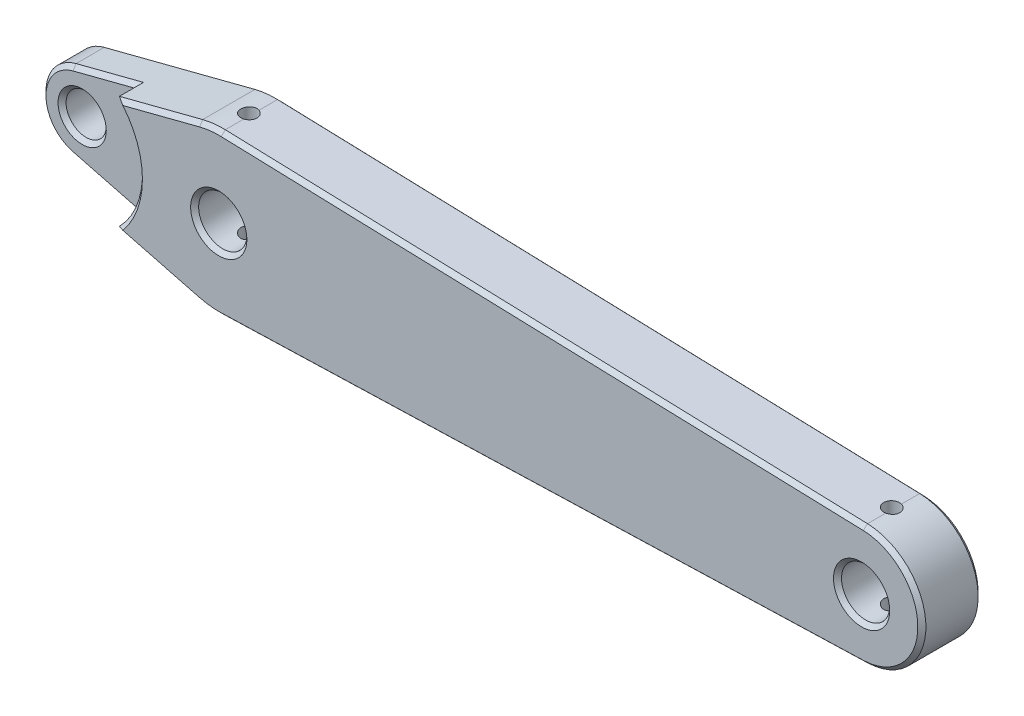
ISO-10303-21;
HEADER;
FILE_DESCRIPTION(('STEP AP214'),'2;1');
FILE_NAME('part.step','',(''),(''),'','','');
FILE_SCHEMA(('AUTOMOTIVE_DESIGN { 1 0 10303 214 1 1 1 1 }'));
ENDSEC;
DATA;
#1=APPLICATION_CONTEXT('core data for automotive mechanical design processes');
#2=APPLICATION_PROTOCOL_DEFINITION('international standard','automotive_design',2000,#1);
#3=PRODUCT_CONTEXT('',#1,'mechanical');
#4=PRODUCT('Part','Part','',(#3));
#5=PRODUCT_RELATED_PRODUCT_CATEGORY('part','',(#4));
#6=PRODUCT_DEFINITION_FORMATION('','',#4);
#7=PRODUCT_DEFINITION_CONTEXT('part definition',#1,'design');
#8=PRODUCT_DEFINITION('design','',#6,#7);
#9=PRODUCT_DEFINITION_SHAPE('','',#8);
#10=(LENGTH_UNIT() NAMED_UNIT(*) SI_UNIT(.MILLI.,.METRE.));
#11=(NAMED_UNIT(*) PLANE_ANGLE_UNIT() SI_UNIT($,.RADIAN.));
#12=(NAMED_UNIT(*) SI_UNIT($,.STERADIAN.) SOLID_ANGLE_UNIT());
#13=UNCERTAINTY_MEASURE_WITH_UNIT(LENGTH_MEASURE(1.E-05),#10,'distance_accuracy_value','');
#14=(GEOMETRIC_REPRESENTATION_CONTEXT(3) GLOBAL_UNCERTAINTY_ASSIGNED_CONTEXT((#13)) GLOBAL_UNIT_ASSIGNED_CONTEXT((#10,
#11,#12)) REPRESENTATION_CONTEXT('',''));
#15=CARTESIAN_POINT('',(0.,0.,0.));
#16=DIRECTION('',(0.,0.,1.));
#17=DIRECTION('',(1.,0.,0.));
#18=AXIS2_PLACEMENT_3D('',#15,#16,#17);
#19=CARTESIAN_POINT('',(-20.,0.,3.75));
#20=DIRECTION('',(0.,0.,-1.));
#21=DIRECTION('',(-1.,0.,0.));
#22=AXIS2_PLACEMENT_3D('',#19,#20,#21);
#23=CYLINDRICAL_SURFACE('',#22,5.);
#24=DIRECTION('',(0.,0.,-1.));
#25=VECTOR('',#24,1.);
#26=CARTESIAN_POINT('',(-21.25,4.84122918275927,3.75));
#27=LINE('',#26,#25);
#28=CARTESIAN_POINT('',(-21.25,4.84122918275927,0.249999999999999));
#29=VERTEX_POINT('',#28);
#30=CARTESIAN_POINT('',(-21.25,4.84122918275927,-3.25000000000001));
#31=VERTEX_POINT('',#30);
#32=EDGE_CURVE('E618',#29,#31,#27,.T.);
#33=ORIENTED_EDGE('',*,*,#32,.T.);
#34=CARTESIAN_POINT('',(-20.,0.,-3.25000000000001));
#35=DIRECTION('',(0.,0.,1.));
#36=DIRECTION('',(1.,0.,0.));
#37=AXIS2_PLACEMENT_3D('',#34,#35,#36);
#38=CIRCLE('',#37,5.);
#39=CARTESIAN_POINT('',(-21.25,-4.84122918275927,-3.25000000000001));
#40=VERTEX_POINT('',#39);
#41=EDGE_CURVE('E517',#31,#40,#38,.T.);
#42=ORIENTED_EDGE('',*,*,#41,.T.);
#43=DIRECTION('',(0.,0.,-1.));
#44=VECTOR('',#43,1.);
#45=CARTESIAN_POINT('',(-21.25,-4.84122918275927,3.75));
#46=LINE('',#45,#44);
#47=CARTESIAN_POINT('',(-21.25,-4.84122918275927,0.249999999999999));
#48=VERTEX_POINT('',#47);
#49=EDGE_CURVE('E616',#48,#40,#46,.T.);
#50=ORIENTED_EDGE('',*,*,#49,.F.);
#51=CARTESIAN_POINT('',(-20.,0.,0.249999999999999));
#52=DIRECTION('',(0.,0.,1.));
#53=DIRECTION('',(1.,0.,0.));
#54=AXIS2_PLACEMENT_3D('',#51,#52,#53);
#55=CIRCLE('',#54,5.);
#56=EDGE_CURVE('E434',#48,#29,#55,.F.);
#57=ORIENTED_EDGE('',*,*,#56,.T.);
#58=EDGE_LOOP('',(#33,#42,#50,#57));
#59=FACE_BOUND('',#58,.T.);
#60=ADVANCED_FACE('F35',(#59),#23,.T.);
#61=CARTESIAN_POINT('',(-20.,0.,3.75));
#62=DIRECTION('',(0.,0.,-1.));
#63=DIRECTION('',(-1.,0.,0.));
#64=AXIS2_PLACEMENT_3D('',#61,#62,#63);
#65=CYLINDRICAL_SURFACE('',#64,2.5);
#66=CARTESIAN_POINT('',(-20.,0.,-3.24999999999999));
#67=DIRECTION('',(0.,0.,1.));
#68=DIRECTION('',(1.,0.,0.));
#69=AXIS2_PLACEMENT_3D('',#66,#67,#68);
#70=CIRCLE('',#69,2.5);
#71=CARTESIAN_POINT('',(-17.5,0.,-3.24999999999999));
#72=VERTEX_POINT('',#71);
#73=EDGE_CURVE('E504',#72,#72,#70,.F.);
#74=ORIENTED_EDGE('',*,*,#73,.T.);
#75=EDGE_LOOP('',(#74));
#76=FACE_BOUND('',#75,.T.);
#77=CARTESIAN_POINT('',(-20.,0.,0.249999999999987));
#78=DIRECTION('',(0.,0.,1.));
#79=DIRECTION('',(1.,0.,0.));
#80=AXIS2_PLACEMENT_3D('',#77,#78,#79);
#81=CIRCLE('',#80,2.5);
#82=CARTESIAN_POINT('',(-17.5,0.,0.249999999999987));
#83=VERTEX_POINT('',#82);
#84=EDGE_CURVE('E501',#83,#83,#81,.T.);
#85=ORIENTED_EDGE('',*,*,#84,.T.);
#86=EDGE_LOOP('',(#85));
#87=FACE_BOUND('',#86,.T.);
#88=ADVANCED_FACE('F278',(#76,#87),#65,.F.);
#89=CARTESIAN_POINT('',(0.,0.,3.75));
#90=DIRECTION('',(0.,0.,1.));
#91=DIRECTION('',(1.,0.,0.));
#92=AXIS2_PLACEMENT_3D('',#89,#90,#91);
#93=PLANE('',#92);
#94=CARTESIAN_POINT('',(80.,0.,3.75));
#95=DIRECTION('',(0.,0.,1.));
#96=DIRECTION('',(1.,0.,0.));
#97=AXIS2_PLACEMENT_3D('',#94,#95,#96);
#98=CIRCLE('',#97,3.49999999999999);
#99=CARTESIAN_POINT('',(83.5,0.,3.75));
#100=VERTEX_POINT('',#99);
#101=EDGE_CURVE('E557',#100,#100,#98,.F.);
#102=ORIENTED_EDGE('',*,*,#101,.T.);
#103=EDGE_LOOP('',(#102));
#104=FACE_BOUND('',#103,.T.);
#105=CARTESIAN_POINT('',(0.,0.,3.75));
#106=DIRECTION('',(0.,0.,1.));
#107=DIRECTION('',(1.,0.,0.));
#108=AXIS2_PLACEMENT_3D('',#105,#106,#107);
#109=CIRCLE('',#108,3.5);
#110=CARTESIAN_POINT('',(3.5,0.,3.75));
#111=VERTEX_POINT('',#110);
#112=EDGE_CURVE('E554',#111,#111,#109,.F.);
#113=ORIENTED_EDGE('',*,*,#112,.T.);
#114=EDGE_LOOP('',(#113));
#115=FACE_BOUND('',#114,.T.);
#116=CARTESIAN_POINT('',(0.,0.,3.75));
#117=DIRECTION('',(0.,0.,1.));
#118=DIRECTION('',(1.,0.,0.));
#119=AXIS2_PLACEMENT_3D('',#116,#117,#118);
#120=CIRCLE('',#119,9.49999999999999);
#121=CARTESIAN_POINT('',(0.296875,9.49536019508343,3.75));
#122=VERTEX_POINT('',#121);
#123=CARTESIAN_POINT('',(-2.375,9.19833544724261,3.75));
#124=VERTEX_POINT('',#123);
#125=EDGE_CURVE('E549',#122,#124,#120,.T.);
#126=ORIENTED_EDGE('',*,*,#125,.T.);
#127=DIRECTION('',(-0.968245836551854,-0.25,0.));
#128=VECTOR('',#127,1.);
#129=CARTESIAN_POINT('',(-12.7397450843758,6.52216977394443,3.75));
#130=LINE('',#129,#128);
#131=CARTESIAN_POINT('',(-11.9394134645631,6.72881450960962,3.75));
#132=VERTEX_POINT('',#131);
#133=EDGE_CURVE('E551',#124,#132,#130,.T.);
#134=ORIENTED_EDGE('',*,*,#133,.T.);
#135=CARTESIAN_POINT('',(-20.,0.,3.75));
#136=DIRECTION('',(0.,0.,1.));
#137=DIRECTION('',(1.,0.,0.));
#138=AXIS2_PLACEMENT_3D('',#135,#136,#137);
#139=CIRCLE('',#138,10.5);
#140=CARTESIAN_POINT('',(-11.9394134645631,-6.72881450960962,3.75));
#141=VERTEX_POINT('',#140);
#142=EDGE_CURVE('E537',#132,#141,#139,.F.);
#143=ORIENTED_EDGE('',*,*,#142,.T.);
#144=DIRECTION('',(0.968245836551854,-0.25,0.));
#145=VECTOR('',#144,1.);
#146=CARTESIAN_POINT('',(-2.375,-9.19833544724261,3.75));
#147=LINE('',#146,#145);
#148=CARTESIAN_POINT('',(-2.375,-9.19833544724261,3.75));
#149=VERTEX_POINT('',#148);
#150=EDGE_CURVE('E539',#141,#149,#147,.T.);
#151=ORIENTED_EDGE('',*,*,#150,.T.);
#152=CARTESIAN_POINT('',(0.,0.,3.75));
#153=DIRECTION('',(0.,0.,1.));
#154=DIRECTION('',(1.,0.,0.));
#155=AXIS2_PLACEMENT_3D('',#152,#153,#154);
#156=CIRCLE('',#155,9.49999999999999);
#157=CARTESIAN_POINT('',(0.296875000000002,-9.49536019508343,3.75));
#158=VERTEX_POINT('',#157);
#159=EDGE_CURVE('E541',#149,#158,#156,.T.);
#160=ORIENTED_EDGE('',*,*,#159,.T.);
#161=DIRECTION('',(0.999511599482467,0.03125,0.));
#162=VECTOR('',#161,1.);
#163=CARTESIAN_POINT('',(80.21875,-6.99658119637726,3.75));
#164=LINE('',#163,#162);
#165=CARTESIAN_POINT('',(80.21875,-6.99658119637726,3.75));
#166=VERTEX_POINT('',#165);
#167=EDGE_CURVE('E543',#158,#166,#164,.T.);
#168=ORIENTED_EDGE('',*,*,#167,.T.);
#169=CARTESIAN_POINT('',(80.,0.,3.75));
#170=DIRECTION('',(0.,0.,1.));
#171=DIRECTION('',(1.,0.,0.));
#172=AXIS2_PLACEMENT_3D('',#169,#170,#171);
#173=CIRCLE('',#172,6.99999999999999);
#174=CARTESIAN_POINT('',(80.21875,6.99658119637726,3.75));
#175=VERTEX_POINT('',#174);
#176=EDGE_CURVE('E545',#166,#175,#173,.T.);
#177=ORIENTED_EDGE('',*,*,#176,.T.);
#178=DIRECTION('',(-0.999511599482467,0.03125,0.));
#179=VECTOR('',#178,1.);
#180=CARTESIAN_POINT('',(0.296875,9.49536019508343,3.75));
#181=LINE('',#180,#179);
#182=EDGE_CURVE('E547',#175,#122,#181,.T.);
#183=ORIENTED_EDGE('',*,*,#182,.T.);
#184=EDGE_LOOP('',(#126,#134,#143,#151,#160,#168,#177,#183));
#185=FACE_BOUND('',#184,.T.);
#186=ADVANCED_FACE('F282',(#104,#115,#185),#93,.T.);
#187=CARTESIAN_POINT('',(0.,0.,-3.75));
#188=DIRECTION('',(0.,0.,1.));
#189=DIRECTION('',(1.,0.,0.));
#190=AXIS2_PLACEMENT_3D('',#187,#188,#189);
#191=PLANE('',#190);
#192=CARTESIAN_POINT('',(80.,0.,-3.75));
#193=DIRECTION('',(0.,0.,1.));
#194=DIRECTION('',(1.,0.,0.));
#195=AXIS2_PLACEMENT_3D('',#192,#193,#194);
#196=CIRCLE('',#195,3.5);
#197=CARTESIAN_POINT('',(83.5,0.,-3.75));
#198=VERTEX_POINT('',#197);
#199=EDGE_CURVE('E486',#198,#198,#196,.T.);
#200=ORIENTED_EDGE('',*,*,#199,.T.);
#201=EDGE_LOOP('',(#200));
#202=FACE_BOUND('',#201,.T.);
#203=CARTESIAN_POINT('',(0.,0.,-3.75));
#204=DIRECTION('',(0.,0.,1.));
#205=DIRECTION('',(1.,0.,0.));
#206=AXIS2_PLACEMENT_3D('',#203,#204,#205);
#207=CIRCLE('',#206,3.5);
#208=CARTESIAN_POINT('',(3.5,0.,-3.75));
#209=VERTEX_POINT('',#208);
#210=EDGE_CURVE('E483',#209,#209,#207,.T.);
#211=ORIENTED_EDGE('',*,*,#210,.T.);
#212=EDGE_LOOP('',(#211));
#213=FACE_BOUND('',#212,.T.);
#214=CARTESIAN_POINT('',(-20.,0.,-3.75));
#215=DIRECTION('',(0.,0.,1.));
#216=DIRECTION('',(1.,0.,0.));
#217=AXIS2_PLACEMENT_3D('',#214,#215,#216);
#218=CIRCLE('',#217,2.99999999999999);
#219=CARTESIAN_POINT('',(-17.,0.,-3.75));
#220=VERTEX_POINT('',#219);
#221=EDGE_CURVE('E480',#220,#220,#218,.T.);
#222=ORIENTED_EDGE('',*,*,#221,.T.);
#223=EDGE_LOOP('',(#222));
#224=FACE_BOUND('',#223,.T.);
#225=CARTESIAN_POINT('',(-20.,0.,-3.75));
#226=DIRECTION('',(0.,0.,1.));
#227=DIRECTION('',(1.,0.,0.));
#228=AXIS2_PLACEMENT_3D('',#225,#226,#227);
#229=CIRCLE('',#228,4.5);
#230=CARTESIAN_POINT('',(-21.125,-4.35710626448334,-3.75));
#231=VERTEX_POINT('',#230);
#232=CARTESIAN_POINT('',(-21.125,4.35710626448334,-3.75));
#233=VERTEX_POINT('',#232);
#234=EDGE_CURVE('E470',#231,#233,#229,.F.);
#235=ORIENTED_EDGE('',*,*,#234,.T.);
#236=DIRECTION('',(0.968245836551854,0.25,0.));
#237=VECTOR('',#236,1.);
#238=CARTESIAN_POINT('',(-2.375,9.19833544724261,-3.75));
#239=LINE('',#238,#237);
#240=CARTESIAN_POINT('',(-2.375,9.19833544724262,-3.75));
#241=VERTEX_POINT('',#240);
#242=EDGE_CURVE('E472',#233,#241,#239,.T.);
#243=ORIENTED_EDGE('',*,*,#242,.T.);
#244=CARTESIAN_POINT('',(0.,0.,-3.75));
#245=DIRECTION('',(0.,0.,1.));
#246=DIRECTION('',(1.,0.,0.));
#247=AXIS2_PLACEMENT_3D('',#244,#245,#246);
#248=CIRCLE('',#247,9.5);
#249=CARTESIAN_POINT('',(0.296875,9.49536019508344,-3.75));
#250=VERTEX_POINT('',#249);
#251=EDGE_CURVE('E622',#241,#250,#248,.F.);
#252=ORIENTED_EDGE('',*,*,#251,.T.);
#253=DIRECTION('',(0.999511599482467,-0.03125,0.));
#254=VECTOR('',#253,1.);
#255=CARTESIAN_POINT('',(0.296875,9.49536019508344,-3.75));
#256=LINE('',#255,#254);
#257=CARTESIAN_POINT('',(80.21875,6.99658119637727,-3.75));
#258=VERTEX_POINT('',#257);
#259=EDGE_CURVE('E623',#250,#258,#256,.T.);
#260=ORIENTED_EDGE('',*,*,#259,.T.);
#261=CARTESIAN_POINT('',(80.,0.,-3.75));
#262=DIRECTION('',(0.,0.,1.));
#263=DIRECTION('',(1.,0.,0.));
#264=AXIS2_PLACEMENT_3D('',#261,#262,#263);
#265=CIRCLE('',#264,7.);
#266=CARTESIAN_POINT('',(80.21875,-6.99658119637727,-3.75));
#267=VERTEX_POINT('',#266);
#268=EDGE_CURVE('E627',#258,#267,#265,.F.);
#269=ORIENTED_EDGE('',*,*,#268,.T.);
#270=DIRECTION('',(-0.999511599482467,-0.03125,0.));
#271=VECTOR('',#270,1.);
#272=CARTESIAN_POINT('',(0.296875,-9.49536019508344,-3.75));
#273=LINE('',#272,#271);
#274=CARTESIAN_POINT('',(0.296875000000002,-9.49536019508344,-3.75));
#275=VERTEX_POINT('',#274);
#276=EDGE_CURVE('E474',#267,#275,#273,.T.);
#277=ORIENTED_EDGE('',*,*,#276,.T.);
#278=CARTESIAN_POINT('',(0.,0.,-3.75));
#279=DIRECTION('',(0.,0.,1.));
#280=DIRECTION('',(1.,0.,0.));
#281=AXIS2_PLACEMENT_3D('',#278,#279,#280);
#282=CIRCLE('',#281,9.5);
#283=CARTESIAN_POINT('',(-2.375,-9.19833544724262,-3.75));
#284=VERTEX_POINT('',#283);
#285=EDGE_CURVE('E372',#275,#284,#282,.F.);
#286=ORIENTED_EDGE('',*,*,#285,.T.);
#287=DIRECTION('',(-0.968245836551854,0.25,0.));
#288=VECTOR('',#287,1.);
#289=CARTESIAN_POINT('',(-2.375,-9.19833544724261,-3.75));
#290=LINE('',#289,#288);
#291=EDGE_CURVE('E467',#284,#231,#290,.T.);
#292=ORIENTED_EDGE('',*,*,#291,.T.);
#293=EDGE_LOOP('',(#235,#243,#252,#260,#269,#277,#286,#292));
#294=FACE_BOUND('',#293,.T.);
#295=ADVANCED_FACE('F286',(#202,#213,#224,#294),#191,.F.);
#296=CARTESIAN_POINT('',(0.,0.,3.75));
#297=DIRECTION('',(0.,0.,-1.));
#298=DIRECTION('',(-1.,0.,0.));
#299=AXIS2_PLACEMENT_3D('',#296,#297,#298);
#300=CYLINDRICAL_SURFACE('',#299,10.);
#301=DIRECTION('',(0.,0.,-1.));
#302=VECTOR('',#301,1.);
#303=CARTESIAN_POINT('',(0.3125,9.99511599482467,3.75));
#304=LINE('',#303,#302);
#305=CARTESIAN_POINT('',(0.3125,9.99511599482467,-0.949917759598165));
#306=VERTEX_POINT('',#305);
#307=CARTESIAN_POINT('',(0.3125,9.99511599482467,-3.25000000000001));
#308=VERTEX_POINT('',#307);
#309=EDGE_CURVE('E332',#306,#308,#304,.T.);
#310=ORIENTED_EDGE('',*,*,#309,.T.);
#311=CARTESIAN_POINT('',(0.,0.,-3.25000000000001));
#312=DIRECTION('',(0.,0.,1.));
#313=DIRECTION('',(1.,0.,0.));
#314=AXIS2_PLACEMENT_3D('',#311,#312,#313);
#315=CIRCLE('',#314,10.);
#316=CARTESIAN_POINT('',(-2.5,9.68245836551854,-3.25000000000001));
#317=VERTEX_POINT('',#316);
#318=EDGE_CURVE('E535',#308,#317,#315,.T.);
#319=ORIENTED_EDGE('',*,*,#318,.T.);
#320=DIRECTION('',(0.,0.,-1.));
#321=VECTOR('',#320,1.);
#322=CARTESIAN_POINT('',(-2.5,9.68245836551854,3.75));
#323=LINE('',#322,#321);
#324=CARTESIAN_POINT('',(-2.5,9.68245836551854,3.25));
#325=VERTEX_POINT('',#324);
#326=EDGE_CURVE('E586',#325,#317,#323,.T.);
#327=ORIENTED_EDGE('',*,*,#326,.F.);
#328=CARTESIAN_POINT('',(0.,0.,3.25));
#329=DIRECTION('',(0.,0.,1.));
#330=DIRECTION('',(1.,0.,0.));
#331=AXIS2_PLACEMENT_3D('',#328,#329,#330);
#332=CIRCLE('',#331,10.);
#333=CARTESIAN_POINT('',(0.3125,9.99511599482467,3.25));
#334=VERTEX_POINT('',#333);
#335=EDGE_CURVE('E533',#325,#334,#332,.F.);
#336=ORIENTED_EDGE('',*,*,#335,.T.);
#337=CARTESIAN_POINT('',(0.3125,9.99511599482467,0.949917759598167));
#338=VERTEX_POINT('',#337);
#339=EDGE_CURVE('E333',#334,#338,#304,.T.);
#340=ORIENTED_EDGE('',*,*,#339,.T.);
#341=CARTESIAN_POINT('',(0.,10.,1.));
#342=CARTESIAN_POINT('',(-0.0560203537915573,9.9999993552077,0.99999757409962));
#343=CARTESIAN_POINT('',(-0.112077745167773,9.99952425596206,0.995276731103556));
#344=CARTESIAN_POINT('',(-0.222638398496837,9.99767467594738,0.976515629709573));
#345=CARTESIAN_POINT('',(-0.277139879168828,9.99629920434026,0.962465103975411));
#346=CARTESIAN_POINT('',(-0.382971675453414,9.9928041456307,0.925457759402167));
#347=CARTESIAN_POINT('',(-0.43430388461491,9.99068500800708,0.902506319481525));
#348=CARTESIAN_POINT('',(-0.532376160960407,9.98593957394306,0.848359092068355));
#349=CARTESIAN_POINT('',(-0.579117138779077,9.98331337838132,0.817164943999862));
#350=CARTESIAN_POINT('',(-0.666859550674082,9.97783744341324,0.747297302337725));
#351=CARTESIAN_POINT('',(-0.707842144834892,9.97498701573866,0.708600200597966));
#352=CARTESIAN_POINT('',(-0.782742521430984,9.96938956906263,0.62487546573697));
#353=CARTESIAN_POINT('',(-0.816659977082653,9.96664255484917,0.579847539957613));
#354=CARTESIAN_POINT('',(-0.876533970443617,9.96155591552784,0.484621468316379));
#355=CARTESIAN_POINT('',(-0.90247346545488,9.95921716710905,0.434412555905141));
#356=CARTESIAN_POINT('',(-0.94554638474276,9.95522037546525,0.330324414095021));
#357=CARTESIAN_POINT('',(-0.962680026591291,9.95356231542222,0.27644527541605));
#358=CARTESIAN_POINT('',(-0.987599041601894,9.95112084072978,0.16673819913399));
#359=CARTESIAN_POINT('',(-0.995415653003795,9.95033450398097,0.110917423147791));
#360=CARTESIAN_POINT('',(-1.00157528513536,9.94971643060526,-0.00124886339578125));
#361=CARTESIAN_POINT('',(-0.999918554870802,9.94988466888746,-0.05759436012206));
#362=CARTESIAN_POINT('',(-0.987204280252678,9.95115406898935,-0.168995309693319));
#363=CARTESIAN_POINT('',(-0.976180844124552,9.95225184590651,-0.224054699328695));
#364=CARTESIAN_POINT('',(-0.945099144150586,9.95525134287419,-0.331537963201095));
#365=CARTESIAN_POINT('',(-0.925040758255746,9.95715307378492,-0.383961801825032));
#366=CARTESIAN_POINT('',(-0.876420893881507,9.9615500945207,-0.48479358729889));
#367=CARTESIAN_POINT('',(-0.847844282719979,9.96404643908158,-0.533194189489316));
#368=CARTESIAN_POINT('',(-0.783010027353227,9.96935051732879,-0.624525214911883));
#369=CARTESIAN_POINT('',(-0.746752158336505,9.97215826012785,-0.667455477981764));
#370=CARTESIAN_POINT('',(-0.667394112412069,9.9777838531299,-0.746825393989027));
#371=CARTESIAN_POINT('',(-0.624264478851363,9.98060169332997,-0.783235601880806));
#372=CARTESIAN_POINT('',(-0.532489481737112,9.98591829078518,-0.848303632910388));
#373=CARTESIAN_POINT('',(-0.4838441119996,9.98841704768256,-0.876961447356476));
#374=CARTESIAN_POINT('',(-0.382398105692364,9.99281475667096,-0.925710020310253));
#375=CARTESIAN_POINT('',(-0.329596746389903,9.9947136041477,-0.945799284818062));
#376=CARTESIAN_POINT('',(-0.221347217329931,9.99769647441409,-0.976818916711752));
#377=CARTESIAN_POINT('',(-0.1658991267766,9.99878052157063,-0.987749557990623));
#378=CARTESIAN_POINT('',(-0.0541850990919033,10.0000085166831,-1.00010430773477));
#379=CARTESIAN_POINT('',(0.00207630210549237,10.0001564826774,-1.0015690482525));
#380=CARTESIAN_POINT('',(0.1140437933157,9.99950641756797,-0.995057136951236));
#381=CARTESIAN_POINT('',(0.16974989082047,9.99870839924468,-0.987080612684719));
#382=CARTESIAN_POINT('',(0.278908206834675,9.99625861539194,-0.961946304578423));
#383=CARTESIAN_POINT('',(0.33236484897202,9.99460861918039,-0.944807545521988));
#384=CARTESIAN_POINT('',(0.435644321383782,9.99063998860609,-0.901854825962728));
#385=CARTESIAN_POINT('',(0.485467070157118,9.98832133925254,-0.876040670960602));
#386=CARTESIAN_POINT('',(0.580248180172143,9.98326475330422,-0.816369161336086));
#387=CARTESIAN_POINT('',(0.625189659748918,9.98052543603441,-0.782485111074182));
#388=CARTESIAN_POINT('',(0.708761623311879,9.9749393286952,-0.707673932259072));
#389=CARTESIAN_POINT('',(0.747391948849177,9.97209253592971,-0.666746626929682));
#390=CARTESIAN_POINT('',(0.817386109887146,9.96660024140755,-0.578833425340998));
#391=CARTESIAN_POINT('',(0.848723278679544,9.96395550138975,-0.531826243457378));
#392=CARTESIAN_POINT('',(0.903058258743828,9.9591783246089,-0.433192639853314));
#393=CARTESIAN_POINT('',(0.926056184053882,9.95704588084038,-0.381566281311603));
#394=CARTESIAN_POINT('',(0.963015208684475,9.9535394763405,-0.275251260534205));
#395=CARTESIAN_POINT('',(0.976992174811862,9.95216418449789,-0.220568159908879));
#396=CARTESIAN_POINT('',(0.995564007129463,9.95032365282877,-0.109616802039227));
#397=CARTESIAN_POINT('',(1.00015914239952,9.94985838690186,-0.0533485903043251));
#398=CARTESIAN_POINT('',(0.999833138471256,9.94989113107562,0.0589106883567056));
#399=CARTESIAN_POINT('',(0.994953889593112,9.95038490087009,0.114901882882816));
#400=CARTESIAN_POINT('',(0.975905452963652,9.95227103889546,0.225264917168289));
#401=CARTESIAN_POINT('',(0.961736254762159,9.95366340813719,0.279636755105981));
#402=CARTESIAN_POINT('',(0.924521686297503,9.95718868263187,0.385217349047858));
#403=CARTESIAN_POINT('',(0.901477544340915,9.95932148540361,0.436426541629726));
#404=CARTESIAN_POINT('',(0.847171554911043,9.96408751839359,0.534256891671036));
#405=CARTESIAN_POINT('',(0.815909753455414,9.96672074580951,0.580878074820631));
#406=CARTESIAN_POINT('',(0.745898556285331,9.97220487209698,0.668423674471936));
#407=CARTESIAN_POINT('',(0.707117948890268,9.97505664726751,0.709323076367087));
#408=CARTESIAN_POINT('',(0.623231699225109,9.98064854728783,0.784052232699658));
#409=CARTESIAN_POINT('',(0.578124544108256,9.98338864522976,0.81788029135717));
#410=CARTESIAN_POINT('',(0.482741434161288,9.98845562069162,0.877573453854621));
#411=CARTESIAN_POINT('',(0.432452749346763,9.99078144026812,0.903418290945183));
#412=CARTESIAN_POINT('',(0.32825827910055,9.99474629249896,0.946262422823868));
#413=CARTESIAN_POINT('',(0.274356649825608,9.99638609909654,0.963271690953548));
#414=CARTESIAN_POINT('',(0.183458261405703,9.99838213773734,0.983720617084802));
#415=CARTESIAN_POINT('',(0.147042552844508,9.99898600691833,0.989817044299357));
#416=CARTESIAN_POINT('',(0.0737565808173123,9.99979514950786,0.997957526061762));
#417=CARTESIAN_POINT('',(0.0368863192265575,10.0000004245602,1.00000159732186));
#418=CARTESIAN_POINT('',(0.,10.,1.));
#419=B_SPLINE_CURVE_WITH_KNOTS('',3,(#341,#342,#343,#344,#345,#346,#347,#348,#349,#350,#351,
#352,#353,#354,#355,#356,#357,#358,#359,#360,#361,#362,#363,#364,#365,#366,#367,#368,#369,#370,
#371,#372,#373,#374,#375,#376,#377,#378,#379,#380,#381,#382,#383,#384,#385,#386,#387,#388,#389,
#390,#391,#392,#393,#394,#395,#396,#397,#398,#399,#400,#401,#402,#403,#404,#405,#406,#407,#408,
#409,#410,#411,#412,#413,#414,#415,#416,#417,#418),.UNSPECIFIED.,.T.,.F.,(4,2,2,2,2,2,2,2,2,2,2,
2,2,2,2,2,2,2,2,2,2,2,2,2,2,2,2,2,2,2,2,2,2,2,2,2,2,2,4),(0.,0.167926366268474,
0.336037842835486,0.504047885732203,0.672024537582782,0.840538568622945,1.00906039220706,
1.17793975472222,1.34681494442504,1.51512232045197,1.68342527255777,1.85111797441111,
2.01881294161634,2.18680761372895,2.35480720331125,2.52354734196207,2.69228766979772,
2.86105740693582,3.02982209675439,3.19786188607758,3.36589940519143,3.53358935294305,
3.70128306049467,3.86953940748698,4.0377999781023,4.20666643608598,4.37553058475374,
4.54409690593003,4.71265839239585,4.88047629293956,5.0482943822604,5.216089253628,
5.3838831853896,5.55238917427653,5.72093552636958,5.88990631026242,6.05868594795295,
6.16925667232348,6.27982694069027),.UNSPECIFIED.);
#420=EDGE_CURVE('E317',#338,#306,#419,.T.);
#421=ORIENTED_EDGE('',*,*,#420,.T.);
#422=EDGE_LOOP('',(#310,#319,#327,#336,#340,#421));
#423=FACE_BOUND('',#422,.T.);
#424=ADVANCED_FACE('F289',(#423),#300,.T.);
#425=CARTESIAN_POINT('',(-21.25,4.84122918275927,3.75));
#426=DIRECTION('',(0.25,-0.968245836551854,0.));
#427=DIRECTION('',(0.968245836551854,0.25,0.));
#428=AXIS2_PLACEMENT_3D('',#425,#426,#427);
#429=PLANE('',#428);
#430=ORIENTED_EDGE('',*,*,#326,.T.);
#431=DIRECTION('',(-0.968245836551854,-0.25,0.));
#432=VECTOR('',#431,1.);
#433=CARTESIAN_POINT('',(-21.25,4.84122918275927,-3.25000000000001));
#434=LINE('',#433,#432);
#435=EDGE_CURVE('E513',#317,#31,#434,.T.);
#436=ORIENTED_EDGE('',*,*,#435,.T.);
#437=ORIENTED_EDGE('',*,*,#32,.F.);
#438=DIRECTION('',(0.968245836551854,0.25,0.));
#439=VECTOR('',#438,1.);
#440=CARTESIAN_POINT('',(-12.8647450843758,7.00629269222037,0.249999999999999));
#441=LINE('',#440,#439);
#442=CARTESIAN_POINT('',(-12.8647450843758,7.00629269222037,0.249999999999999));
#443=VERTEX_POINT('',#442);
#444=EDGE_CURVE('E507',#29,#443,#441,.T.);
#445=ORIENTED_EDGE('',*,*,#444,.T.);
#446=DIRECTION('',(0.,0.,1.));
#447=VECTOR('',#446,1.);
#448=CARTESIAN_POINT('',(-12.8647450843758,7.00629269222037,0.75));
#449=LINE('',#448,#447);
#450=CARTESIAN_POINT('',(-12.8647450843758,7.00629269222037,3.25));
#451=VERTEX_POINT('',#450);
#452=EDGE_CURVE('E564',#443,#451,#449,.T.);
#453=ORIENTED_EDGE('',*,*,#452,.T.);
#454=DIRECTION('',(0.968245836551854,0.25,0.));
#455=VECTOR('',#454,1.);
#456=CARTESIAN_POINT('',(-2.5,9.68245836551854,3.25));
#457=LINE('',#456,#455);
#458=EDGE_CURVE('E510',#451,#325,#457,.T.);
#459=ORIENTED_EDGE('',*,*,#458,.T.);
#460=EDGE_LOOP('',(#430,#436,#437,#445,#453,#459));
#461=FACE_BOUND('',#460,.T.);
#462=ADVANCED_FACE('F306',(#461),#429,.F.);
#463=CARTESIAN_POINT('',(-21.25,-4.84122918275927,3.75));
#464=DIRECTION('',(0.25,0.968245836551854,0.));
#465=DIRECTION('',(-0.968245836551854,0.25,0.));
#466=AXIS2_PLACEMENT_3D('',#463,#464,#465);
#467=PLANE('',#466);
#468=ORIENTED_EDGE('',*,*,#49,.T.);
#469=DIRECTION('',(0.968245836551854,-0.25,0.));
#470=VECTOR('',#469,1.);
#471=CARTESIAN_POINT('',(-21.25,-4.84122918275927,-3.25000000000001));
#472=LINE('',#471,#470);
#473=CARTESIAN_POINT('',(-2.5,-9.68245836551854,-3.25000000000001));
#474=VERTEX_POINT('',#473);
#475=EDGE_CURVE('E466',#40,#474,#472,.T.);
#476=ORIENTED_EDGE('',*,*,#475,.T.);
#477=DIRECTION('',(0.,0.,-1.));
#478=VECTOR('',#477,1.);
#479=CARTESIAN_POINT('',(-2.5,-9.68245836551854,3.75));
#480=LINE('',#479,#478);
#481=CARTESIAN_POINT('',(-2.5,-9.68245836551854,3.25));
#482=VERTEX_POINT('',#481);
#483=EDGE_CURVE('E613',#482,#474,#480,.T.);
#484=ORIENTED_EDGE('',*,*,#483,.F.);
#485=DIRECTION('',(-0.968245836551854,0.25,0.));
#486=VECTOR('',#485,1.);
#487=CARTESIAN_POINT('',(-12.8647450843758,-7.00629269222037,3.25));
#488=LINE('',#487,#486);
#489=CARTESIAN_POINT('',(-12.8647450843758,-7.00629269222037,3.25));
#490=VERTEX_POINT('',#489);
#491=EDGE_CURVE('E520',#482,#490,#488,.T.);
#492=ORIENTED_EDGE('',*,*,#491,.T.);
#493=DIRECTION('',(0.,0.,1.));
#494=VECTOR('',#493,1.);
#495=CARTESIAN_POINT('',(-12.8647450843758,-7.00629269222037,0.75));
#496=LINE('',#495,#494);
#497=CARTESIAN_POINT('',(-12.8647450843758,-7.00629269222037,0.249999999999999));
#498=VERTEX_POINT('',#497);
#499=EDGE_CURVE('E565',#490,#498,#496,.F.);
#500=ORIENTED_EDGE('',*,*,#499,.T.);
#501=DIRECTION('',(-0.968245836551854,0.25,0.));
#502=VECTOR('',#501,1.);
#503=CARTESIAN_POINT('',(-21.25,-4.84122918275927,0.249999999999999));
#504=LINE('',#503,#502);
#505=EDGE_CURVE('E438',#498,#48,#504,.T.);
#506=ORIENTED_EDGE('',*,*,#505,.T.);
#507=EDGE_LOOP('',(#468,#476,#484,#492,#500,#506));
#508=FACE_BOUND('',#507,.T.);
#509=ADVANCED_FACE('F304',(#508),#467,.F.);
#510=CARTESIAN_POINT('',(0.,0.,3.75));
#511=DIRECTION('',(0.,0.,-1.));
#512=DIRECTION('',(-1.,0.,0.));
#513=AXIS2_PLACEMENT_3D('',#510,#511,#512);
#514=CYLINDRICAL_SURFACE('',#513,10.);
#515=ORIENTED_EDGE('',*,*,#483,.T.);
#516=CARTESIAN_POINT('',(0.,0.,-3.25000000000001));
#517=DIRECTION('',(0.,0.,1.));
#518=DIRECTION('',(1.,0.,0.));
#519=AXIS2_PLACEMENT_3D('',#516,#517,#518);
#520=CIRCLE('',#519,10.);
#521=CARTESIAN_POINT('',(0.312500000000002,-9.99511599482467,-3.25000000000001));
#522=VERTEX_POINT('',#521);
#523=EDGE_CURVE('E370',#474,#522,#520,.T.);
#524=ORIENTED_EDGE('',*,*,#523,.T.);
#525=DIRECTION('',(0.,0.,-1.));
#526=VECTOR('',#525,1.);
#527=CARTESIAN_POINT('',(0.312500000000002,-9.99511599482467,3.75));
#528=LINE('',#527,#526);
#529=CARTESIAN_POINT('',(0.312500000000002,-9.99511599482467,-0.949917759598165));
#530=VERTEX_POINT('',#529);
#531=EDGE_CURVE('E344',#530,#522,#528,.T.);
#532=ORIENTED_EDGE('',*,*,#531,.F.);
#533=CARTESIAN_POINT('',(0.,-10.,1.));
#534=CARTESIAN_POINT('',(0.0560203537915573,-9.9999993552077,0.99999757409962));
#535=CARTESIAN_POINT('',(0.112077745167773,-9.99952425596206,0.995276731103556));
#536=CARTESIAN_POINT('',(0.222638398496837,-9.99767467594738,0.976515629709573));
#537=CARTESIAN_POINT('',(0.277139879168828,-9.99629920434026,0.962465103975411));
#538=CARTESIAN_POINT('',(0.382971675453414,-9.9928041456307,0.925457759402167));
#539=CARTESIAN_POINT('',(0.43430388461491,-9.99068500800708,0.902506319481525));
#540=CARTESIAN_POINT('',(0.532376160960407,-9.98593957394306,0.848359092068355));
#541=CARTESIAN_POINT('',(0.579117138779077,-9.98331337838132,0.817164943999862));
#542=CARTESIAN_POINT('',(0.666859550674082,-9.97783744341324,0.747297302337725));
#543=CARTESIAN_POINT('',(0.707842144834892,-9.97498701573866,0.708600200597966));
#544=CARTESIAN_POINT('',(0.782742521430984,-9.96938956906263,0.62487546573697));
#545=CARTESIAN_POINT('',(0.816659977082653,-9.96664255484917,0.579847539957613));
#546=CARTESIAN_POINT('',(0.876533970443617,-9.96155591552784,0.484621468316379));
#547=CARTESIAN_POINT('',(0.90247346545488,-9.95921716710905,0.434412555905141));
#548=CARTESIAN_POINT('',(0.94554638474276,-9.95522037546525,0.330324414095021));
#549=CARTESIAN_POINT('',(0.962680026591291,-9.95356231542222,0.27644527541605));
#550=CARTESIAN_POINT('',(0.987599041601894,-9.95112084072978,0.16673819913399));
#551=CARTESIAN_POINT('',(0.995415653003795,-9.95033450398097,0.110917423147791));
#552=CARTESIAN_POINT('',(1.00157528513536,-9.94971643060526,-0.00124886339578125));
#553=CARTESIAN_POINT('',(0.999918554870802,-9.94988466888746,-0.05759436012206));
#554=CARTESIAN_POINT('',(0.987204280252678,-9.95115406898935,-0.168995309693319));
#555=CARTESIAN_POINT('',(0.976180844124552,-9.95225184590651,-0.224054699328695));
#556=CARTESIAN_POINT('',(0.945099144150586,-9.95525134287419,-0.331537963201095));
#557=CARTESIAN_POINT('',(0.925040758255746,-9.95715307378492,-0.383961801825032));
#558=CARTESIAN_POINT('',(0.876420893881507,-9.9615500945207,-0.48479358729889));
#559=CARTESIAN_POINT('',(0.847844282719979,-9.96404643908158,-0.533194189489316));
#560=CARTESIAN_POINT('',(0.783010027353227,-9.96935051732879,-0.624525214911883));
#561=CARTESIAN_POINT('',(0.746752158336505,-9.97215826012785,-0.667455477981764));
#562=CARTESIAN_POINT('',(0.667394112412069,-9.9777838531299,-0.746825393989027));
#563=CARTESIAN_POINT('',(0.624264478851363,-9.98060169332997,-0.783235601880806));
#564=CARTESIAN_POINT('',(0.532489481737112,-9.98591829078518,-0.848303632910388));
#565=CARTESIAN_POINT('',(0.4838441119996,-9.98841704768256,-0.876961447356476));
#566=CARTESIAN_POINT('',(0.382398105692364,-9.99281475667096,-0.925710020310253));
#567=CARTESIAN_POINT('',(0.329596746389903,-9.9947136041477,-0.945799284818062));
#568=CARTESIAN_POINT('',(0.221347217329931,-9.99769647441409,-0.976818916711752));
#569=CARTESIAN_POINT('',(0.1658991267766,-9.99878052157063,-0.987749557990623));
#570=CARTESIAN_POINT('',(0.0541850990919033,-10.0000085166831,-1.00010430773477));
#571=CARTESIAN_POINT('',(-0.00207630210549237,-10.0001564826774,-1.0015690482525));
#572=CARTESIAN_POINT('',(-0.1140437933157,-9.99950641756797,-0.995057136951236));
#573=CARTESIAN_POINT('',(-0.16974989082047,-9.99870839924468,-0.987080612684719));
#574=CARTESIAN_POINT('',(-0.278908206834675,-9.99625861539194,-0.961946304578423));
#575=CARTESIAN_POINT('',(-0.33236484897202,-9.99460861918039,-0.944807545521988));
#576=CARTESIAN_POINT('',(-0.435644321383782,-9.99063998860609,-0.901854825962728));
#577=CARTESIAN_POINT('',(-0.485467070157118,-9.98832133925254,-0.876040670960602));
#578=CARTESIAN_POINT('',(-0.580248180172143,-9.98326475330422,-0.816369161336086));
#579=CARTESIAN_POINT('',(-0.625189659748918,-9.98052543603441,-0.782485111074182));
#580=CARTESIAN_POINT('',(-0.708761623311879,-9.9749393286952,-0.707673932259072));
#581=CARTESIAN_POINT('',(-0.747391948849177,-9.97209253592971,-0.666746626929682));
#582=CARTESIAN_POINT('',(-0.817386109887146,-9.96660024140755,-0.578833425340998));
#583=CARTESIAN_POINT('',(-0.848723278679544,-9.96395550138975,-0.531826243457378));
#584=CARTESIAN_POINT('',(-0.903058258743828,-9.9591783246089,-0.433192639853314));
#585=CARTESIAN_POINT('',(-0.926056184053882,-9.95704588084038,-0.381566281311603));
#586=CARTESIAN_POINT('',(-0.963015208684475,-9.9535394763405,-0.275251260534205));
#587=CARTESIAN_POINT('',(-0.976992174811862,-9.95216418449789,-0.220568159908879));
#588=CARTESIAN_POINT('',(-0.995564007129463,-9.95032365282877,-0.109616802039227));
#589=CARTESIAN_POINT('',(-1.00015914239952,-9.94985838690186,-0.0533485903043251));
#590=CARTESIAN_POINT('',(-0.999833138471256,-9.94989113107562,0.0589106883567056));
#591=CARTESIAN_POINT('',(-0.994953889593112,-9.95038490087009,0.114901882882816));
#592=CARTESIAN_POINT('',(-0.975905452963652,-9.95227103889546,0.225264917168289));
#593=CARTESIAN_POINT('',(-0.961736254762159,-9.95366340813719,0.279636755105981));
#594=CARTESIAN_POINT('',(-0.924521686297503,-9.95718868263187,0.385217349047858));
#595=CARTESIAN_POINT('',(-0.901477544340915,-9.95932148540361,0.436426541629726));
#596=CARTESIAN_POINT('',(-0.847171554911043,-9.96408751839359,0.534256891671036));
#597=CARTESIAN_POINT('',(-0.815909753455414,-9.96672074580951,0.580878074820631));
#598=CARTESIAN_POINT('',(-0.745898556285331,-9.97220487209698,0.668423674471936));
#599=CARTESIAN_POINT('',(-0.707117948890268,-9.97505664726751,0.709323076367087));
#600=CARTESIAN_POINT('',(-0.623231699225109,-9.98064854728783,0.784052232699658));
#601=CARTESIAN_POINT('',(-0.578124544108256,-9.98338864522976,0.81788029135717));
#602=CARTESIAN_POINT('',(-0.482741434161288,-9.98845562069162,0.877573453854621));
#603=CARTESIAN_POINT('',(-0.432452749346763,-9.99078144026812,0.903418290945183));
#604=CARTESIAN_POINT('',(-0.32825827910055,-9.99474629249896,0.946262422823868));
#605=CARTESIAN_POINT('',(-0.274356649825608,-9.99638609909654,0.963271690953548));
#606=CARTESIAN_POINT('',(-0.183458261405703,-9.99838213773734,0.983720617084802));
#607=CARTESIAN_POINT('',(-0.147042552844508,-9.99898600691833,0.989817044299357));
#608=CARTESIAN_POINT('',(-0.0737565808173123,-9.99979514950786,0.997957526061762));
#609=CARTESIAN_POINT('',(-0.0368863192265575,-10.0000004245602,1.00000159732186));
#610=CARTESIAN_POINT('',(0.,-10.,1.));
#611=B_SPLINE_CURVE_WITH_KNOTS('',3,(#533,#534,#535,#536,#537,#538,#539,#540,#541,#542,#543,
#544,#545,#546,#547,#548,#549,#550,#551,#552,#553,#554,#555,#556,#557,#558,#559,#560,#561,#562,
#563,#564,#565,#566,#567,#568,#569,#570,#571,#572,#573,#574,#575,#576,#577,#578,#579,#580,#581,
#582,#583,#584,#585,#586,#587,#588,#589,#590,#591,#592,#593,#594,#595,#596,#597,#598,#599,#600,
#601,#602,#603,#604,#605,#606,#607,#608,#609,#610),.UNSPECIFIED.,.T.,.F.,(4,2,2,2,2,2,2,2,2,2,2,
2,2,2,2,2,2,2,2,2,2,2,2,2,2,2,2,2,2,2,2,2,2,2,2,2,2,2,4),(0.,0.167926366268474,
0.336037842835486,0.504047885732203,0.672024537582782,0.840538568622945,1.00906039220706,
1.17793975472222,1.34681494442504,1.51512232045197,1.68342527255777,1.85111797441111,
2.01881294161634,2.18680761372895,2.35480720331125,2.52354734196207,2.69228766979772,
2.86105740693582,3.02982209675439,3.19786188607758,3.36589940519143,3.53358935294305,
3.70128306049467,3.86953940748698,4.0377999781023,4.20666643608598,4.37553058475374,
4.54409690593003,4.71265839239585,4.88047629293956,5.0482943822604,5.216089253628,
5.3838831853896,5.55238917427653,5.72093552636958,5.88990631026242,6.05868594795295,
6.16925667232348,6.27982694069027),.UNSPECIFIED.);
#612=CARTESIAN_POINT('',(0.312500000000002,-9.99511599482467,0.949917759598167));
#613=VERTEX_POINT('',#612);
#614=EDGE_CURVE('E327',#530,#613,#611,.T.);
#615=ORIENTED_EDGE('',*,*,#614,.T.);
#616=CARTESIAN_POINT('',(0.312500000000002,-9.99511599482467,3.25));
#617=VERTEX_POINT('',#616);
#618=EDGE_CURVE('E349',#617,#613,#528,.T.);
#619=ORIENTED_EDGE('',*,*,#618,.F.);
#620=CARTESIAN_POINT('',(0.,0.,3.25));
#621=DIRECTION('',(0.,0.,1.));
#622=DIRECTION('',(1.,0.,0.));
#623=AXIS2_PLACEMENT_3D('',#620,#621,#622);
#624=CIRCLE('',#623,10.);
#625=EDGE_CURVE('E523',#617,#482,#624,.F.);
#626=ORIENTED_EDGE('',*,*,#625,.T.);
#627=EDGE_LOOP('',(#515,#524,#532,#615,#619,#626));
#628=FACE_BOUND('',#627,.T.);
#629=ADVANCED_FACE('F334',(#628),#514,.T.);
#630=CARTESIAN_POINT('',(0.3125,-9.99511599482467,3.75));
#631=DIRECTION('',(-0.03125,0.999511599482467,0.));
#632=DIRECTION('',(-0.999511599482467,-0.03125,0.));
#633=AXIS2_PLACEMENT_3D('',#630,#631,#632);
#634=PLANE('',#633);
#635=ORIENTED_EDGE('',*,*,#531,.T.);
#636=DIRECTION('',(0.999511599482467,0.03125,0.));
#637=VECTOR('',#636,1.);
#638=CARTESIAN_POINT('',(0.3125,-9.99511599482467,-3.25000000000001));
#639=LINE('',#638,#637);
#640=CARTESIAN_POINT('',(80.234375,-7.49633699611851,-3.25000000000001));
#641=VERTEX_POINT('',#640);
#642=EDGE_CURVE('E347',#522,#641,#639,.T.);
#643=ORIENTED_EDGE('',*,*,#642,.T.);
#644=DIRECTION('',(0.,0.,-1.));
#645=VECTOR('',#644,1.);
#646=CARTESIAN_POINT('',(80.234375,-7.49633699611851,3.75));
#647=LINE('',#646,#645);
#648=CARTESIAN_POINT('',(80.234375,-7.49633699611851,-0.972146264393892));
#649=VERTEX_POINT('',#648);
#650=EDGE_CURVE('E212',#649,#641,#647,.T.);
#651=ORIENTED_EDGE('',*,*,#650,.F.);
#652=CARTESIAN_POINT('',(80.,-7.50366479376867,0.));
#653=DIRECTION('',(-0.03125,0.999511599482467,0.));
#654=DIRECTION('',(0.999511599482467,0.03125,0.));
#655=AXIS2_PLACEMENT_3D('',#652,#653,#654);
#656=ELLIPSE('',#655,1.00048863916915,0.999999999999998);
#657=CARTESIAN_POINT('',(80.2343750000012,-7.49633699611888,0.972146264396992));
#658=VERTEX_POINT('',#657);
#659=EDGE_CURVE('E225',#649,#658,#656,.T.);
#660=ORIENTED_EDGE('',*,*,#659,.T.);
#661=CARTESIAN_POINT('',(80.234375,-7.49633699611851,3.25));
#662=VERTEX_POINT('',#661);
#663=EDGE_CURVE('E350',#662,#658,#647,.T.);
#664=ORIENTED_EDGE('',*,*,#663,.F.);
#665=DIRECTION('',(-0.999511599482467,-0.03125,0.));
#666=VECTOR('',#665,1.);
#667=CARTESIAN_POINT('',(0.312500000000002,-9.99511599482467,3.25));
#668=LINE('',#667,#666);
#669=EDGE_CURVE('E364',#662,#617,#668,.T.);
#670=ORIENTED_EDGE('',*,*,#669,.T.);
#671=ORIENTED_EDGE('',*,*,#618,.T.);
#672=CARTESIAN_POINT('',(0.,-10.0048863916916,0.));
#673=DIRECTION('',(-0.03125,0.999511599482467,0.));
#674=DIRECTION('',(0.999511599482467,0.03125,0.));
#675=AXIS2_PLACEMENT_3D('',#672,#673,#674);
#676=ELLIPSE('',#675,1.00048863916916,1.);
#677=EDGE_CURVE('E323',#613,#530,#676,.T.);
#678=ORIENTED_EDGE('',*,*,#677,.T.);
#679=EDGE_LOOP('',(#635,#643,#651,#660,#664,#670,#671,#678));
#680=FACE_BOUND('',#679,.T.);
#681=ADVANCED_FACE('F295',(#680),#634,.F.);
#682=CARTESIAN_POINT('',(80.,0.,3.75));
#683=DIRECTION('',(0.,0.,-1.));
#684=DIRECTION('',(-1.,0.,0.));
#685=AXIS2_PLACEMENT_3D('',#682,#683,#684);
#686=CYLINDRICAL_SURFACE('',#685,7.5);
#687=ORIENTED_EDGE('',*,*,#650,.T.);
#688=CARTESIAN_POINT('',(80.,0.,-3.25000000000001));
#689=DIRECTION('',(0.,0.,1.));
#690=DIRECTION('',(1.,0.,0.));
#691=AXIS2_PLACEMENT_3D('',#688,#689,#690);
#692=CIRCLE('',#691,7.5);
#693=CARTESIAN_POINT('',(80.234375,7.49633699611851,-3.25000000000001));
#694=VERTEX_POINT('',#693);
#695=EDGE_CURVE('E528',#641,#694,#692,.T.);
#696=ORIENTED_EDGE('',*,*,#695,.T.);
#697=DIRECTION('',(0.,0.,-1.));
#698=VECTOR('',#697,1.);
#699=CARTESIAN_POINT('',(80.234375,7.49633699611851,3.75));
#700=LINE('',#699,#698);
#701=CARTESIAN_POINT('',(80.234375,7.49633699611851,-0.972146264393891));
#702=VERTEX_POINT('',#701);
#703=EDGE_CURVE('E213',#702,#694,#700,.T.);
#704=ORIENTED_EDGE('',*,*,#703,.F.);
#705=CARTESIAN_POINT('',(80.,7.5,0.999999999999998));
#706=CARTESIAN_POINT('',(79.9440955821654,7.49999917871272,0.999997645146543));
#707=CARTESIAN_POINT('',(79.8881570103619,7.49936835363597,0.995296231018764));
#708=CARTESIAN_POINT('',(79.777838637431,7.49691255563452,0.976616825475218));
#709=CARTESIAN_POINT('',(79.7234604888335,7.49508636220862,0.962629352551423));
#710=CARTESIAN_POINT('',(79.6178758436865,7.49044539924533,0.925799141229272));
#711=CARTESIAN_POINT('',(79.5666671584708,7.48763132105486,0.902962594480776));
#712=CARTESIAN_POINT('',(79.4688180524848,7.48132693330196,0.849096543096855));
#713=CARTESIAN_POINT('',(79.4221768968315,7.47783673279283,0.818068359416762));
#714=CARTESIAN_POINT('',(79.3344870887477,7.47054497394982,0.748493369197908));
#715=CARTESIAN_POINT('',(79.2934710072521,7.46674179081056,0.709905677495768));
#716=CARTESIAN_POINT('',(79.2184763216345,7.45926568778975,0.626394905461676));
#717=CARTESIAN_POINT('',(79.1844980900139,7.45559277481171,0.581471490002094));
#718=CARTESIAN_POINT('',(79.1244204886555,7.44877717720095,0.486350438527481));
#719=CARTESIAN_POINT('',(79.0983519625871,7.44563658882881,0.436133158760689));
#720=CARTESIAN_POINT('',(79.0550307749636,7.44026293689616,0.331984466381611));
#721=CARTESIAN_POINT('',(79.0377777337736,7.43802983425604,0.278053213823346));
#722=CARTESIAN_POINT('',(79.0126769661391,7.43473968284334,0.168347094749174));
#723=CARTESIAN_POINT('',(79.0047739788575,7.43367572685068,0.112585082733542));
#724=CARTESIAN_POINT('',(78.9984265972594,7.43282325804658,0.000516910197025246));
#725=CARTESIAN_POINT('',(78.999981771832,7.433034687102,-0.0557892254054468));
#726=CARTESIAN_POINT('',(79.0124612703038,7.43470277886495,-0.166960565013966));
#727=CARTESIAN_POINT('',(79.0233245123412,7.43615132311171,-0.221832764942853));
#728=CARTESIAN_POINT('',(79.0540163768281,7.44011776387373,-0.328968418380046));
#729=CARTESIAN_POINT('',(79.0738452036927,7.44263568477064,-0.381231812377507));
#730=CARTESIAN_POINT('',(79.121970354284,7.44846630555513,-0.481854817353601));
#731=CARTESIAN_POINT('',(79.1502930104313,7.4517814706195,-0.530201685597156));
#732=CARTESIAN_POINT('',(79.2145830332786,7.45883118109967,-0.621479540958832));
#733=CARTESIAN_POINT('',(79.2505507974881,7.46256574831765,-0.664410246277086));
#734=CARTESIAN_POINT('',(79.3294475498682,7.47006949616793,-0.743991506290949));
#735=CARTESIAN_POINT('',(79.3724291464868,7.47383871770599,-0.780589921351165));
#736=CARTESIAN_POINT('',(79.4639529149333,7.48095961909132,-0.846061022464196));
#737=CARTESIAN_POINT('',(79.5124951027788,7.48431129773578,-0.874933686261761));
#738=CARTESIAN_POINT('',(79.6138038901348,7.4902219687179,-0.924134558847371));
#739=CARTESIAN_POINT('',(79.6665722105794,7.49278063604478,-0.944459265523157));
#740=CARTESIAN_POINT('',(79.7748145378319,7.49681412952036,-0.975944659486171));
#741=CARTESIAN_POINT('',(79.8302884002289,7.49828901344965,-0.987105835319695));
#742=CARTESIAN_POINT('',(79.9419165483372,7.49998120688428,-0.999879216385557));
#743=CARTESIAN_POINT('',(79.9980624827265,7.50020796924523,-1.00156320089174));
#744=CARTESIAN_POINT('',(80.1098358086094,7.49940395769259,-0.995524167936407));
#745=CARTESIAN_POINT('',(80.1654632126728,7.498373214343,-0.987801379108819));
#746=CARTESIAN_POINT('',(80.2744068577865,7.49517587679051,-0.963227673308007));
#747=CARTESIAN_POINT('',(80.327731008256,7.49301357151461,-0.946411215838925));
#748=CARTESIAN_POINT('',(80.4308025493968,7.48779504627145,-0.904163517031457));
#749=CARTESIAN_POINT('',(80.4805498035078,7.4847387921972,-0.878731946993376));
#750=CARTESIAN_POINT('',(80.575374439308,7.47804918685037,-0.819803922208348));
#751=CARTESIAN_POINT('',(80.6204229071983,7.47441257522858,-0.786261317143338));
#752=CARTESIAN_POINT('',(80.7042764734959,7.46697864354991,-0.712128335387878));
#753=CARTESIAN_POINT('',(80.7430812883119,7.4631813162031,-0.67153763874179));
#754=CARTESIAN_POINT('',(80.8136027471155,7.45582451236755,-0.58414342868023));
#755=CARTESIAN_POINT('',(80.8452716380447,7.45226674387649,-0.537301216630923));
#756=CARTESIAN_POINT('',(80.9002917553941,7.44582066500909,-0.438920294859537));
#757=CARTESIAN_POINT('',(80.9236431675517,7.44293233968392,-0.387381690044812));
#758=CARTESIAN_POINT('',(80.9612891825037,7.43816405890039,-0.281221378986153));
#759=CARTESIAN_POINT('',(80.975610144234,7.43628117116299,-0.226609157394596));
#760=CARTESIAN_POINT('',(80.9948733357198,7.43372874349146,-0.115728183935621));
#761=CARTESIAN_POINT('',(80.9998160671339,7.43305913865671,-0.0594595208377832));
#762=CARTESIAN_POINT('',(81.0001724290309,7.43301115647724,0.0526617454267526));
#763=CARTESIAN_POINT('',(80.9956610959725,7.4336226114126,0.10851412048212));
#764=CARTESIAN_POINT('',(80.9773968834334,7.43604591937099,0.218658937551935));
#765=CARTESIAN_POINT('',(80.9636440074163,7.43785777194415,0.272951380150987));
#766=CARTESIAN_POINT('',(80.927311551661,7.44247445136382,0.378421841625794));
#767=CARTESIAN_POINT('',(80.9047361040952,7.445278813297,0.429601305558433));
#768=CARTESIAN_POINT('',(80.8514067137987,7.45156522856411,0.527457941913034));
#769=CARTESIAN_POINT('',(80.8206526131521,7.45504729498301,0.574135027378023));
#770=CARTESIAN_POINT('',(80.7515622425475,7.46232983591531,0.662044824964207));
#771=CARTESIAN_POINT('',(80.7131701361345,7.46613252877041,0.703233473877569));
#772=CARTESIAN_POINT('',(80.6300108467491,7.47360859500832,0.778611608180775));
#773=CARTESIAN_POINT('',(80.5852421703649,7.47728193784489,0.812799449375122));
#774=CARTESIAN_POINT('',(80.4903764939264,7.48410317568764,0.873333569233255));
#775=CARTESIAN_POINT('',(80.440257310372,7.48724873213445,0.89964533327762));
#776=CARTESIAN_POINT('',(80.3362962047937,7.49263660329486,0.94344029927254));
#777=CARTESIAN_POINT('',(80.2824583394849,7.49487988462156,0.960932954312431));
#778=CARTESIAN_POINT('',(80.1902942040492,7.49767860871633,0.98247400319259));
#779=CARTESIAN_POINT('',(80.1525455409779,7.49854481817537,0.989036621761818));
#780=CARTESIAN_POINT('',(80.076536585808,7.49970579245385,0.997800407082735));
#781=CARTESIAN_POINT('',(80.0382762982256,7.500000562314,1.0000016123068));
#782=CARTESIAN_POINT('',(80.,7.5,0.999999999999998));
#783=B_SPLINE_CURVE_WITH_KNOTS('',3,(#705,#706,#707,#708,#709,#710,#711,#712,#713,#714,#715,
#716,#717,#718,#719,#720,#721,#722,#723,#724,#725,#726,#727,#728,#729,#730,#731,#732,#733,#734,
#735,#736,#737,#738,#739,#740,#741,#742,#743,#744,#745,#746,#747,#748,#749,#750,#751,#752,#753,
#754,#755,#756,#757,#758,#759,#760,#761,#762,#763,#764,#765,#766,#767,#768,#769,#770,#771,#772,
#773,#774,#775,#776,#777,#778,#779,#780,#781,#782),.UNSPECIFIED.,.T.,.F.,(4,2,2,2,2,2,2,2,2,2,2,
2,2,2,2,2,2,2,2,2,2,2,2,2,2,2,2,2,2,2,2,2,2,2,2,2,2,2,4),(0.,0.167573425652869,
0.335318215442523,0.502945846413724,0.670546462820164,0.839079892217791,1.00762223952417,
1.17681360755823,1.34599768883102,1.51417677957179,1.6823482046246,1.84942442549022,
2.01650445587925,2.18410791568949,2.35172009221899,2.52065272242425,2.68958583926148,
2.8585881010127,3.02758135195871,3.1952929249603,3.36300042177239,3.53007681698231,
3.69715958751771,3.8652163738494,4.03328079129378,4.20243852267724,4.37159247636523,
4.54025037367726,4.70889924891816,4.87621463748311,5.04352996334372,5.2107670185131,
5.37800730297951,5.54651833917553,5.71506890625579,5.88434763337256,6.05344452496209,
6.16817869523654,6.28291185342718),.UNSPECIFIED.);
#784=CARTESIAN_POINT('',(80.234375,7.49633699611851,0.972146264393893));
#785=VERTEX_POINT('',#784);
#786=EDGE_CURVE('E217',#702,#785,#783,.T.);
#787=ORIENTED_EDGE('',*,*,#786,.T.);
#788=CARTESIAN_POINT('',(80.234375,7.49633699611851,3.25));
#789=VERTEX_POINT('',#788);
#790=EDGE_CURVE('E200',#789,#785,#700,.T.);
#791=ORIENTED_EDGE('',*,*,#790,.F.);
#792=CARTESIAN_POINT('',(80.,0.,3.25));
#793=DIRECTION('',(0.,0.,1.));
#794=DIRECTION('',(1.,0.,0.));
#795=AXIS2_PLACEMENT_3D('',#792,#793,#794);
#796=CIRCLE('',#795,7.5);
#797=EDGE_CURVE('E363',#789,#662,#796,.F.);
#798=ORIENTED_EDGE('',*,*,#797,.T.);
#799=ORIENTED_EDGE('',*,*,#663,.T.);
#800=CARTESIAN_POINT('',(80.,-7.5,0.999999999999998));
#801=CARTESIAN_POINT('',(80.0559044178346,-7.49999917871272,0.999997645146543));
#802=CARTESIAN_POINT('',(80.1118429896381,-7.49936835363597,0.995296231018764));
#803=CARTESIAN_POINT('',(80.222161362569,-7.49691255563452,0.976616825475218));
#804=CARTESIAN_POINT('',(80.2765395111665,-7.49508636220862,0.962629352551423));
#805=CARTESIAN_POINT('',(80.3821241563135,-7.49044539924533,0.925799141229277));
#806=CARTESIAN_POINT('',(80.4333328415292,-7.48763132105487,0.902962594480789));
#807=CARTESIAN_POINT('',(80.5311819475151,-7.48132693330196,0.849096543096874));
#808=CARTESIAN_POINT('',(80.5778231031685,-7.47783673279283,0.818068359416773));
#809=CARTESIAN_POINT('',(80.6655129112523,-7.47054497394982,0.748493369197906));
#810=CARTESIAN_POINT('',(80.7065289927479,-7.46674179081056,0.709905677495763));
#811=CARTESIAN_POINT('',(80.7815236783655,-7.45926568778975,0.62639490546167));
#812=CARTESIAN_POINT('',(80.8155019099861,-7.45559277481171,0.581471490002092));
#813=CARTESIAN_POINT('',(80.8755795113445,-7.44877717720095,0.486350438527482));
#814=CARTESIAN_POINT('',(80.9016480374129,-7.44563658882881,0.43613315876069));
#815=CARTESIAN_POINT('',(80.9449692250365,-7.44026293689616,0.331984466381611));
#816=CARTESIAN_POINT('',(80.9622222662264,-7.43802983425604,0.278053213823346));
#817=CARTESIAN_POINT('',(80.9873230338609,-7.43473968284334,0.168347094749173));
#818=CARTESIAN_POINT('',(80.9952260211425,-7.43367572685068,0.112585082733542));
#819=CARTESIAN_POINT('',(81.0015734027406,-7.43282325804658,0.000516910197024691));
#820=CARTESIAN_POINT('',(81.000018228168,-7.433034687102,-0.055789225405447));
#821=CARTESIAN_POINT('',(80.9875387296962,-7.43470277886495,-0.166960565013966));
#822=CARTESIAN_POINT('',(80.9766754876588,-7.43615132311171,-0.221832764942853));
#823=CARTESIAN_POINT('',(80.9459836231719,-7.44011776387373,-0.328968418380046));
#824=CARTESIAN_POINT('',(80.9261547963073,-7.44263568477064,-0.381231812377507));
#825=CARTESIAN_POINT('',(80.878029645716,-7.44846630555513,-0.481854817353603));
#826=CARTESIAN_POINT('',(80.8497069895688,-7.4517814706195,-0.530201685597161));
#827=CARTESIAN_POINT('',(80.7854169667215,-7.45883118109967,-0.621479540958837));
#828=CARTESIAN_POINT('',(80.7494492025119,-7.46256574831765,-0.664410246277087));
#829=CARTESIAN_POINT('',(80.6705524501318,-7.47006949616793,-0.743991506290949));
#830=CARTESIAN_POINT('',(80.6275708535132,-7.47383871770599,-0.780589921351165));
#831=CARTESIAN_POINT('',(80.5360470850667,-7.48095961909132,-0.846061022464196));
#832=CARTESIAN_POINT('',(80.4875048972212,-7.48431129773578,-0.874933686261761));
#833=CARTESIAN_POINT('',(80.3861961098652,-7.4902219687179,-0.924134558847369));
#834=CARTESIAN_POINT('',(80.3334277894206,-7.49278063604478,-0.944459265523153));
#835=CARTESIAN_POINT('',(80.2251854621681,-7.49681412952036,-0.975944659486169));
#836=CARTESIAN_POINT('',(80.1697115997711,-7.49828901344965,-0.987105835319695));
#837=CARTESIAN_POINT('',(80.0580834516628,-7.49998120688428,-0.999879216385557));
#838=CARTESIAN_POINT('',(80.0019375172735,-7.50020796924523,-1.00156320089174));
#839=CARTESIAN_POINT('',(79.8901641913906,-7.49940395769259,-0.995524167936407));
#840=CARTESIAN_POINT('',(79.8345367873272,-7.498373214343,-0.987801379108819));
#841=CARTESIAN_POINT('',(79.7255931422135,-7.49517587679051,-0.963227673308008));
#842=CARTESIAN_POINT('',(79.672268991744,-7.49301357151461,-0.946411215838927));
#843=CARTESIAN_POINT('',(79.5691974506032,-7.48779504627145,-0.90416351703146));
#844=CARTESIAN_POINT('',(79.5194501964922,-7.4847387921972,-0.878731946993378));
#845=CARTESIAN_POINT('',(79.424625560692,-7.47804918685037,-0.819803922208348));
#846=CARTESIAN_POINT('',(79.3795770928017,-7.47441257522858,-0.786261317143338));
#847=CARTESIAN_POINT('',(79.2957235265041,-7.46697864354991,-0.712128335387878));
#848=CARTESIAN_POINT('',(79.2569187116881,-7.4631813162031,-0.67153763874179));
#849=CARTESIAN_POINT('',(79.1863972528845,-7.45582451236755,-0.58414342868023));
#850=CARTESIAN_POINT('',(79.1547283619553,-7.45226674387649,-0.537301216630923));
#851=CARTESIAN_POINT('',(79.0997082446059,-7.44582066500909,-0.438920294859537));
#852=CARTESIAN_POINT('',(79.0763568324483,-7.44293233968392,-0.387381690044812));
#853=CARTESIAN_POINT('',(79.0387108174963,-7.43816405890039,-0.281221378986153));
#854=CARTESIAN_POINT('',(79.024389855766,-7.43628117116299,-0.226609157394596));
#855=CARTESIAN_POINT('',(79.0051266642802,-7.43372874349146,-0.115728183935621));
#856=CARTESIAN_POINT('',(79.0001839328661,-7.43305913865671,-0.0594595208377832));
#857=CARTESIAN_POINT('',(78.9998275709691,-7.43301115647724,0.0526617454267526));
#858=CARTESIAN_POINT('',(79.0043389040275,-7.4336226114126,0.10851412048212));
#859=CARTESIAN_POINT('',(79.0226031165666,-7.43604591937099,0.218658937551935));
#860=CARTESIAN_POINT('',(79.0363559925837,-7.43785777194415,0.272951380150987));
#861=CARTESIAN_POINT('',(79.072688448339,-7.44247445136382,0.378421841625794));
#862=CARTESIAN_POINT('',(79.0952638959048,-7.445278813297,0.429601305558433));
#863=CARTESIAN_POINT('',(79.1485932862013,-7.45156522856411,0.527457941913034));
#864=CARTESIAN_POINT('',(79.1793473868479,-7.45504729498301,0.574135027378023));
#865=CARTESIAN_POINT('',(79.2484377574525,-7.46232983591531,0.662044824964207));
#866=CARTESIAN_POINT('',(79.2868298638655,-7.46613252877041,0.703233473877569));
#867=CARTESIAN_POINT('',(79.3699891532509,-7.47360859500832,0.778611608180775));
#868=CARTESIAN_POINT('',(79.4147578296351,-7.47728193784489,0.812799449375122));
#869=CARTESIAN_POINT('',(79.5096235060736,-7.48410317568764,0.873333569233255));
#870=CARTESIAN_POINT('',(79.559742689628,-7.48724873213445,0.89964533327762));
#871=CARTESIAN_POINT('',(79.6637037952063,-7.49263660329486,0.94344029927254));
#872=CARTESIAN_POINT('',(79.7175416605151,-7.49487988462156,0.960932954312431));
#873=CARTESIAN_POINT('',(79.8097057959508,-7.49767860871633,0.98247400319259));
#874=CARTESIAN_POINT('',(79.8474544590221,-7.49854481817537,0.989036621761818));
#875=CARTESIAN_POINT('',(79.923463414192,-7.49970579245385,0.997800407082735));
#876=CARTESIAN_POINT('',(79.9617237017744,-7.500000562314,1.0000016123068));
#877=CARTESIAN_POINT('',(80.,-7.5,0.999999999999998));
#878=B_SPLINE_CURVE_WITH_KNOTS('',3,(#800,#801,#802,#803,#804,#805,#806,#807,#808,#809,#810,
#811,#812,#813,#814,#815,#816,#817,#818,#819,#820,#821,#822,#823,#824,#825,#826,#827,#828,#829,
#830,#831,#832,#833,#834,#835,#836,#837,#838,#839,#840,#841,#842,#843,#844,#845,#846,#847,#848,
#849,#850,#851,#852,#853,#854,#855,#856,#857,#858,#859,#860,#861,#862,#863,#864,#865,#866,#867,
#868,#869,#870,#871,#872,#873,#874,#875,#876,#877),.UNSPECIFIED.,.T.,.F.,(4,2,2,2,2,2,2,2,2,2,2,
2,2,2,2,2,2,2,2,2,2,2,2,2,2,2,2,2,2,2,2,2,2,2,2,2,2,2,4),(0.,0.167573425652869,
0.335318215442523,0.502945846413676,0.670546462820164,0.839079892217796,1.00762223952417,
1.17681360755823,1.34599768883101,1.51417677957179,1.68234820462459,1.84942442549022,
2.01650445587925,2.18410791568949,2.35172009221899,2.52065272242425,2.68958583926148,
2.85858810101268,3.02758135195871,3.1952929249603,3.36300042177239,3.5300768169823,
3.69715958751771,3.8652163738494,4.03328079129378,4.20243852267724,4.37159247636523,
4.54025037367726,4.70889924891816,4.87621463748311,5.04352996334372,5.2107670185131,
5.37800730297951,5.54651833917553,5.71506890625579,5.88434763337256,6.05344452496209,
6.16817869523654,6.28291185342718),.UNSPECIFIED.);
#879=EDGE_CURVE('E222',#658,#649,#878,.T.);
#880=ORIENTED_EDGE('',*,*,#879,.T.);
#881=EDGE_LOOP('',(#687,#696,#704,#787,#791,#798,#799,#880));
#882=FACE_BOUND('',#881,.T.);
#883=ADVANCED_FACE('F221',(#882),#686,.T.);
#884=CARTESIAN_POINT('',(0.3125,9.99511599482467,3.75));
#885=DIRECTION('',(-0.03125,-0.999511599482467,0.));
#886=DIRECTION('',(0.999511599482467,-0.03125,0.));
#887=AXIS2_PLACEMENT_3D('',#884,#885,#886);
#888=PLANE('',#887);
#889=ORIENTED_EDGE('',*,*,#703,.T.);
#890=DIRECTION('',(-0.999511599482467,0.03125,0.));
#891=VECTOR('',#890,1.);
#892=CARTESIAN_POINT('',(0.3125,9.99511599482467,-3.25000000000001));
#893=LINE('',#892,#891);
#894=EDGE_CURVE('E531',#694,#308,#893,.T.);
#895=ORIENTED_EDGE('',*,*,#894,.T.);
#896=ORIENTED_EDGE('',*,*,#309,.F.);
#897=CARTESIAN_POINT('',(0.,10.0048863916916,0.));
#898=DIRECTION('',(-0.03125,-0.999511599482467,0.));
#899=DIRECTION('',(-0.999511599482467,0.03125,0.));
#900=AXIS2_PLACEMENT_3D('',#897,#898,#899);
#901=ELLIPSE('',#900,1.00048863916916,1.);
#902=EDGE_CURVE('E324',#306,#338,#901,.T.);
#903=ORIENTED_EDGE('',*,*,#902,.T.);
#904=ORIENTED_EDGE('',*,*,#339,.F.);
#905=DIRECTION('',(0.999511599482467,-0.03125,0.));
#906=VECTOR('',#905,1.);
#907=CARTESIAN_POINT('',(80.234375,7.4963369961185,3.25));
#908=LINE('',#907,#906);
#909=EDGE_CURVE('E208',#334,#789,#908,.T.);
#910=ORIENTED_EDGE('',*,*,#909,.T.);
#911=ORIENTED_EDGE('',*,*,#790,.T.);
#912=CARTESIAN_POINT('',(80.,7.50366479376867,0.));
#913=DIRECTION('',(-0.03125,-0.999511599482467,0.));
#914=DIRECTION('',(-0.999511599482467,0.03125,0.));
#915=AXIS2_PLACEMENT_3D('',#912,#913,#914);
#916=ELLIPSE('',#915,1.00048863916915,0.999999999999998);
#917=EDGE_CURVE('E204',#785,#702,#916,.T.);
#918=ORIENTED_EDGE('',*,*,#917,.T.);
#919=EDGE_LOOP('',(#889,#895,#896,#903,#904,#910,#911,#918));
#920=FACE_BOUND('',#919,.T.);
#921=ADVANCED_FACE('F203',(#920),#888,.F.);
#922=CARTESIAN_POINT('',(0.,0.,3.75));
#923=DIRECTION('',(0.,0.,-1.));
#924=DIRECTION('',(-1.,0.,0.));
#925=AXIS2_PLACEMENT_3D('',#922,#923,#924);
#926=CYLINDRICAL_SURFACE('',#925,3.);
#927=CARTESIAN_POINT('',(0.,0.,-3.24999999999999));
#928=DIRECTION('',(0.,0.,1.));
#929=DIRECTION('',(1.,0.,0.));
#930=AXIS2_PLACEMENT_3D('',#927,#928,#929);
#931=CIRCLE('',#930,3.);
#932=CARTESIAN_POINT('',(3.,0.,-3.24999999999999));
#933=VERTEX_POINT('',#932);
#934=EDGE_CURVE('E498',#933,#933,#931,.F.);
#935=ORIENTED_EDGE('',*,*,#934,.T.);
#936=EDGE_LOOP('',(#935));
#937=FACE_BOUND('',#936,.T.);
#938=CARTESIAN_POINT('',(0.,0.,3.25));
#939=DIRECTION('',(0.,0.,1.));
#940=DIRECTION('',(1.,0.,0.));
#941=AXIS2_PLACEMENT_3D('',#938,#939,#940);
#942=CIRCLE('',#941,3.);
#943=CARTESIAN_POINT('',(3.,0.,3.25));
#944=VERTEX_POINT('',#943);
#945=EDGE_CURVE('E495',#944,#944,#942,.T.);
#946=ORIENTED_EDGE('',*,*,#945,.T.);
#947=EDGE_LOOP('',(#946));
#948=FACE_BOUND('',#947,.T.);
#949=CARTESIAN_POINT('',(0.,-3.,1.));
#950=CARTESIAN_POINT('',(0.0545633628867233,-3.00000015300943,1.00000025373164));
#951=CARTESIAN_POINT('',(0.10912519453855,-2.99849769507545,0.995519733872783));
#952=CARTESIAN_POINT('',(0.216641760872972,-2.99265210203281,0.977770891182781));
#953=CARTESIAN_POINT('',(0.269596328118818,-2.98830867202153,0.964501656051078));
#954=CARTESIAN_POINT('',(0.372332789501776,-2.97725307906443,0.929680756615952));
#955=CARTESIAN_POINT('',(0.422119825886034,-2.97054487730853,0.908142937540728));
#956=CARTESIAN_POINT('',(0.517374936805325,-2.95544445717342,0.857458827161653));
#957=CARTESIAN_POINT('',(0.562842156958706,-2.94705190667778,0.828311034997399));
#958=CARTESIAN_POINT('',(0.649741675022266,-2.92914094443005,0.762174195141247));
#959=CARTESIAN_POINT('',(0.691003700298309,-2.91959556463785,0.724968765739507));
#960=CARTESIAN_POINT('',(0.766832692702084,-2.90060314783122,0.644232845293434));
#961=CARTESIAN_POINT('',(0.801398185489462,-2.89115613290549,0.600700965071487));
#962=CARTESIAN_POINT('',(0.863824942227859,-2.87313332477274,0.50701488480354));
#963=CARTESIAN_POINT('',(0.891464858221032,-2.86459039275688,0.456706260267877));
#964=CARTESIAN_POINT('',(0.937818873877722,-2.84975305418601,0.351823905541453));
#965=CARTESIAN_POINT('',(0.956535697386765,-2.84345796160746,0.297251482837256));
#966=CARTESIAN_POINT('',(0.983873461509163,-2.83411303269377,0.18732677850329));
#967=CARTESIAN_POINT('',(0.992813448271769,-2.83096095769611,0.132062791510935));
#968=CARTESIAN_POINT('',(1.00134112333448,-2.82795656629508,0.020736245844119));
#969=CARTESIAN_POINT('',(1.00093170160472,-2.8281032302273,-0.0353260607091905));
#970=CARTESIAN_POINT('',(0.991019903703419,-2.8315901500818,-0.143936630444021));
#971=CARTESIAN_POINT('',(0.981933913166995,-2.83478415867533,-0.196528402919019));
#972=CARTESIAN_POINT('',(0.955606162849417,-2.84376657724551,-0.299393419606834));
#973=CARTESIAN_POINT('',(0.938363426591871,-2.84955529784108,-0.34966638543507));
#974=CARTESIAN_POINT('',(0.895939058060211,-2.86317911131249,-0.447412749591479));
#975=CARTESIAN_POINT('',(0.870634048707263,-2.87104565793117,-0.494828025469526));
#976=CARTESIAN_POINT('',(0.812889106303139,-2.88792558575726,-0.584870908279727));
#977=CARTESIAN_POINT('',(0.780447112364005,-2.89693929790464,-0.627497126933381));
#978=CARTESIAN_POINT('',(0.707349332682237,-2.91567329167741,-0.709091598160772));
#979=CARTESIAN_POINT('',(0.666353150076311,-2.92540589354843,-0.74775269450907));
#980=CARTESIAN_POINT('',(0.578339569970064,-2.94406938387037,-0.817731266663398));
#981=CARTESIAN_POINT('',(0.531321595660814,-2.95300019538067,-0.849048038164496));
#982=CARTESIAN_POINT('',(0.431947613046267,-2.96917107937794,-0.903696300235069));
#983=CARTESIAN_POINT('',(0.379543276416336,-2.97639350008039,-0.926945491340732));
#984=CARTESIAN_POINT('',(0.271269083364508,-2.98820567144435,-0.964203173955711));
#985=CARTESIAN_POINT('',(0.215400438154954,-2.99279633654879,-0.978214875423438));
#986=CARTESIAN_POINT('',(0.104383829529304,-2.99867627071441,-0.996055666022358));
#987=CARTESIAN_POINT('',(0.0493095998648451,-3.00010001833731,-1.00029980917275));
#988=CARTESIAN_POINT('',(-0.0607750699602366,-2.99988902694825,-0.999667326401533));
#989=CARTESIAN_POINT('',(-0.115785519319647,-2.99825480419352,-0.994792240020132));
#990=CARTESIAN_POINT('',(-0.222519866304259,-2.99220024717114,-0.976388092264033));
#991=CARTESIAN_POINT('',(-0.274292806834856,-2.98786198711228,-0.963113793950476));
#992=CARTESIAN_POINT('',(-0.374855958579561,-2.97691846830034,-0.928606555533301));
#993=CARTESIAN_POINT('',(-0.423645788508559,-2.97031292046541,-0.907372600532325));
#994=CARTESIAN_POINT('',(-0.518288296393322,-2.95528931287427,-0.8569295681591));
#995=CARTESIAN_POINT('',(-0.56402995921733,-2.94682814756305,-0.8275254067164));
#996=CARTESIAN_POINT('',(-0.650064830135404,-2.92905253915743,-0.761805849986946));
#997=CARTESIAN_POINT('',(-0.690356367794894,-2.91973783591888,-0.725488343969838));
#998=CARTESIAN_POINT('',(-0.766252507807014,-2.90076847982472,-0.645021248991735));
#999=CARTESIAN_POINT('',(-0.801560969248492,-2.89111761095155,-0.600590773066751));
#1000=CARTESIAN_POINT('',(-0.864257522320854,-2.87299973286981,-0.5062284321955));
#1001=CARTESIAN_POINT('',(-0.891645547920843,-2.8645327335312,-0.456296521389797));
#1002=CARTESIAN_POINT('',(-0.93759693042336,-2.84982391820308,-0.352326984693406));
#1003=CARTESIAN_POINT('',(-0.956178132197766,-2.84357760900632,-0.298297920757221));
#1004=CARTESIAN_POINT('',(-0.983894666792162,-2.83410832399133,-0.187621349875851));
#1005=CARTESIAN_POINT('',(-0.993034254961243,-2.83088398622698,-0.130975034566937));
#1006=CARTESIAN_POINT('',(-1.00127628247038,-2.82797858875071,-0.019802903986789));
#1007=CARTESIAN_POINT('',(-1.00087025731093,-2.82812400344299,0.0346823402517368));
#1008=CARTESIAN_POINT('',(-0.991242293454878,-2.8315126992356,0.142765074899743));
#1009=CARTESIAN_POINT('',(-0.982020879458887,-2.83475579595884,0.196362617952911));
#1010=CARTESIAN_POINT('',(-0.95537181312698,-2.84384524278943,0.300135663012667));
#1011=CARTESIAN_POINT('',(-0.938103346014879,-2.84964098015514,0.350356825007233));
#1012=CARTESIAN_POINT('',(-0.895979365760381,-2.86316398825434,0.447227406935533));
#1013=CARTESIAN_POINT('',(-0.871122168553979,-2.87089168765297,0.493876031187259));
#1014=CARTESIAN_POINT('',(-0.813260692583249,-2.8878282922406,0.584483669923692));
#1015=CARTESIAN_POINT('',(-0.779948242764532,-2.89708711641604,0.628236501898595));
#1016=CARTESIAN_POINT('',(-0.706642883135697,-2.91583356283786,0.709689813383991));
#1017=CARTESIAN_POINT('',(-0.666648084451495,-2.92532124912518,0.747388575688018));
#1018=CARTESIAN_POINT('',(-0.579241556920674,-2.94390030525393,0.817144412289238));
#1019=CARTESIAN_POINT('',(-0.531601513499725,-2.95296181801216,0.848924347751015));
#1020=CARTESIAN_POINT('',(-0.431357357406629,-2.96925991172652,0.903990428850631));
#1021=CARTESIAN_POINT('',(-0.37875451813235,-2.9764969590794,0.927278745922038));
#1022=CARTESIAN_POINT('',(-0.272493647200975,-2.98805515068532,0.963721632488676));
#1023=CARTESIAN_POINT('',(-0.218987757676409,-2.9924921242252,0.977282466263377));
#1024=CARTESIAN_POINT('',(-0.110320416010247,-2.99846407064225,0.995420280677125));
#1025=CARTESIAN_POINT('',(-0.0551594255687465,-2.99999984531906,0.999999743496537));
#1026=CARTESIAN_POINT('',(0.,-3.,1.));
#1027=B_SPLINE_CURVE_WITH_KNOTS('',3,(#949,#950,#951,#952,#953,#954,#955,#956,#957,#958,#959,
#960,#961,#962,#963,#964,#965,#966,#967,#968,#969,#970,#971,#972,#973,#974,#975,#976,#977,#978,
#979,#980,#981,#982,#983,#984,#985,#986,#987,#988,#989,#990,#991,#992,#993,#994,#995,#996,#997,
#998,#999,#1000,#1001,#1002,#1003,#1004,#1005,#1006,#1007,#1008,#1009,#1010,#1011,#1012,#1013,
#1014,#1015,#1016,#1017,#1018,#1019,#1020,#1021,#1022,#1023,#1024,#1025,#1026),.UNSPECIFIED.,
.T.,.F.,(4,2,2,2,2,2,2,2,2,2,2,2,2,2,2,2,2,2,2,2,2,2,2,2,2,2,2,2,2,2,2,2,2,2,2,2,2,2,4),(0.,
0.163487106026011,0.326991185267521,0.490222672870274,0.6534863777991,0.82184684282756,
0.990244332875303,1.1634838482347,1.33667044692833,1.5040192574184,1.67131633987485,
1.8309682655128,1.99063930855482,2.15288171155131,2.31517102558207,2.48593305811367,
2.65671145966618,2.82918405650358,3.00159668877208,3.1665358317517,3.33144713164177,
3.49158157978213,3.65173645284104,3.81610399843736,3.98052180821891,4.15241022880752,
4.32430008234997,4.49584013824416,4.66730284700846,4.82995666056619,4.99260079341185,
5.15215587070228,5.31174638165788,5.47830066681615,5.64490211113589,5.8179966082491,
5.99104681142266,6.15636558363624,6.3216386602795),.UNSPECIFIED.);
#1028=CARTESIAN_POINT('',(0.,-3.,1.));
#1029=VERTEX_POINT('',#1028);
#1030=EDGE_CURVE('E269',#1029,#1029,#1027,.T.);
#1031=ORIENTED_EDGE('',*,*,#1030,.F.);
#1032=EDGE_LOOP('',(#1031));
#1033=FACE_BOUND('',#1032,.T.);
#1034=CARTESIAN_POINT('',(0.,3.,1.));
#1035=CARTESIAN_POINT('',(-0.0545633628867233,3.00000015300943,1.00000025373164));
#1036=CARTESIAN_POINT('',(-0.10912519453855,2.99849769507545,0.995519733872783));
#1037=CARTESIAN_POINT('',(-0.216641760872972,2.99265210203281,0.977770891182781));
#1038=CARTESIAN_POINT('',(-0.269596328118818,2.98830867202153,0.964501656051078));
#1039=CARTESIAN_POINT('',(-0.372332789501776,2.97725307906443,0.929680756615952));
#1040=CARTESIAN_POINT('',(-0.422119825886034,2.97054487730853,0.908142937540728));
#1041=CARTESIAN_POINT('',(-0.517374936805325,2.95544445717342,0.857458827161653));
#1042=CARTESIAN_POINT('',(-0.562842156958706,2.94705190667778,0.828311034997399));
#1043=CARTESIAN_POINT('',(-0.649741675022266,2.92914094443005,0.762174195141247));
#1044=CARTESIAN_POINT('',(-0.691003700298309,2.91959556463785,0.724968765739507));
#1045=CARTESIAN_POINT('',(-0.766832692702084,2.90060314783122,0.644232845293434));
#1046=CARTESIAN_POINT('',(-0.801398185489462,2.89115613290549,0.600700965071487));
#1047=CARTESIAN_POINT('',(-0.863824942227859,2.87313332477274,0.50701488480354));
#1048=CARTESIAN_POINT('',(-0.891464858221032,2.86459039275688,0.456706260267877));
#1049=CARTESIAN_POINT('',(-0.937818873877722,2.84975305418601,0.351823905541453));
#1050=CARTESIAN_POINT('',(-0.956535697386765,2.84345796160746,0.297251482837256));
#1051=CARTESIAN_POINT('',(-0.983873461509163,2.83411303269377,0.18732677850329));
#1052=CARTESIAN_POINT('',(-0.992813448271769,2.83096095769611,0.132062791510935));
#1053=CARTESIAN_POINT('',(-1.00134112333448,2.82795656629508,0.020736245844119));
#1054=CARTESIAN_POINT('',(-1.00093170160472,2.8281032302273,-0.0353260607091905));
#1055=CARTESIAN_POINT('',(-0.991019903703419,2.8315901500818,-0.143936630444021));
#1056=CARTESIAN_POINT('',(-0.981933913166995,2.83478415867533,-0.196528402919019));
#1057=CARTESIAN_POINT('',(-0.955606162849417,2.84376657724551,-0.299393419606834));
#1058=CARTESIAN_POINT('',(-0.938363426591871,2.84955529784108,-0.34966638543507));
#1059=CARTESIAN_POINT('',(-0.895939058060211,2.86317911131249,-0.447412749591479));
#1060=CARTESIAN_POINT('',(-0.870634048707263,2.87104565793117,-0.494828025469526));
#1061=CARTESIAN_POINT('',(-0.812889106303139,2.88792558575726,-0.584870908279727));
#1062=CARTESIAN_POINT('',(-0.780447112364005,2.89693929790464,-0.627497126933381));
#1063=CARTESIAN_POINT('',(-0.707349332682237,2.91567329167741,-0.709091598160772));
#1064=CARTESIAN_POINT('',(-0.666353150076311,2.92540589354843,-0.74775269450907));
#1065=CARTESIAN_POINT('',(-0.578339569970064,2.94406938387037,-0.817731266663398));
#1066=CARTESIAN_POINT('',(-0.531321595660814,2.95300019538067,-0.849048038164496));
#1067=CARTESIAN_POINT('',(-0.431947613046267,2.96917107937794,-0.903696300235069));
#1068=CARTESIAN_POINT('',(-0.379543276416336,2.97639350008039,-0.926945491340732));
#1069=CARTESIAN_POINT('',(-0.271269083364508,2.98820567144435,-0.964203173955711));
#1070=CARTESIAN_POINT('',(-0.215400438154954,2.99279633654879,-0.978214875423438));
#1071=CARTESIAN_POINT('',(-0.104383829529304,2.99867627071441,-0.996055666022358));
#1072=CARTESIAN_POINT('',(-0.0493095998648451,3.00010001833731,-1.00029980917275));
#1073=CARTESIAN_POINT('',(0.0607750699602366,2.99988902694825,-0.999667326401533));
#1074=CARTESIAN_POINT('',(0.115785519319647,2.99825480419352,-0.994792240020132));
#1075=CARTESIAN_POINT('',(0.222519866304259,2.99220024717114,-0.976388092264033));
#1076=CARTESIAN_POINT('',(0.274292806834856,2.98786198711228,-0.963113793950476));
#1077=CARTESIAN_POINT('',(0.374855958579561,2.97691846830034,-0.928606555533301));
#1078=CARTESIAN_POINT('',(0.423645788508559,2.97031292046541,-0.907372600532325));
#1079=CARTESIAN_POINT('',(0.518288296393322,2.95528931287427,-0.8569295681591));
#1080=CARTESIAN_POINT('',(0.56402995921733,2.94682814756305,-0.8275254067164));
#1081=CARTESIAN_POINT('',(0.650064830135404,2.92905253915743,-0.761805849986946));
#1082=CARTESIAN_POINT('',(0.690356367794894,2.91973783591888,-0.725488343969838));
#1083=CARTESIAN_POINT('',(0.766252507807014,2.90076847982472,-0.645021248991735));
#1084=CARTESIAN_POINT('',(0.801560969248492,2.89111761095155,-0.600590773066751));
#1085=CARTESIAN_POINT('',(0.864257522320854,2.87299973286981,-0.5062284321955));
#1086=CARTESIAN_POINT('',(0.891645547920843,2.8645327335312,-0.456296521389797));
#1087=CARTESIAN_POINT('',(0.93759693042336,2.84982391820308,-0.352326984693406));
#1088=CARTESIAN_POINT('',(0.956178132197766,2.84357760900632,-0.298297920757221));
#1089=CARTESIAN_POINT('',(0.983894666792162,2.83410832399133,-0.187621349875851));
#1090=CARTESIAN_POINT('',(0.993034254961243,2.83088398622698,-0.130975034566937));
#1091=CARTESIAN_POINT('',(1.00127628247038,2.82797858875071,-0.019802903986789));
#1092=CARTESIAN_POINT('',(1.00087025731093,2.82812400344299,0.0346823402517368));
#1093=CARTESIAN_POINT('',(0.991242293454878,2.8315126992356,0.142765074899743));
#1094=CARTESIAN_POINT('',(0.982020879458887,2.83475579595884,0.196362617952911));
#1095=CARTESIAN_POINT('',(0.95537181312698,2.84384524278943,0.300135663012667));
#1096=CARTESIAN_POINT('',(0.938103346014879,2.84964098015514,0.350356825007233));
#1097=CARTESIAN_POINT('',(0.895979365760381,2.86316398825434,0.447227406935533));
#1098=CARTESIAN_POINT('',(0.871122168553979,2.87089168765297,0.493876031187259));
#1099=CARTESIAN_POINT('',(0.813260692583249,2.8878282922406,0.584483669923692));
#1100=CARTESIAN_POINT('',(0.779948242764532,2.89708711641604,0.628236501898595));
#1101=CARTESIAN_POINT('',(0.706642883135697,2.91583356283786,0.709689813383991));
#1102=CARTESIAN_POINT('',(0.666648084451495,2.92532124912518,0.747388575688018));
#1103=CARTESIAN_POINT('',(0.579241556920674,2.94390030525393,0.817144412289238));
#1104=CARTESIAN_POINT('',(0.531601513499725,2.95296181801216,0.848924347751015));
#1105=CARTESIAN_POINT('',(0.431357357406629,2.96925991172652,0.903990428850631));
#1106=CARTESIAN_POINT('',(0.37875451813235,2.9764969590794,0.927278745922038));
#1107=CARTESIAN_POINT('',(0.272493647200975,2.98805515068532,0.963721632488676));
#1108=CARTESIAN_POINT('',(0.218987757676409,2.9924921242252,0.977282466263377));
#1109=CARTESIAN_POINT('',(0.110320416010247,2.99846407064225,0.995420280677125));
#1110=CARTESIAN_POINT('',(0.0551594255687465,2.99999984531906,0.999999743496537));
#1111=CARTESIAN_POINT('',(0.,3.,1.));
#1112=B_SPLINE_CURVE_WITH_KNOTS('',3,(#1034,#1035,#1036,#1037,#1038,#1039,#1040,#1041,#1042,
#1043,#1044,#1045,#1046,#1047,#1048,#1049,#1050,#1051,#1052,#1053,#1054,#1055,#1056,#1057,#1058,
#1059,#1060,#1061,#1062,#1063,#1064,#1065,#1066,#1067,#1068,#1069,#1070,#1071,#1072,#1073,#1074,
#1075,#1076,#1077,#1078,#1079,#1080,#1081,#1082,#1083,#1084,#1085,#1086,#1087,#1088,#1089,#1090,
#1091,#1092,#1093,#1094,#1095,#1096,#1097,#1098,#1099,#1100,#1101,#1102,#1103,#1104,#1105,#1106,
#1107,#1108,#1109,#1110,#1111),.UNSPECIFIED.,.T.,.F.,(4,2,2,2,2,2,2,2,2,2,2,2,2,2,2,2,2,2,2,2,2,
2,2,2,2,2,2,2,2,2,2,2,2,2,2,2,2,2,4),(0.,0.163487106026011,0.326991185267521,0.490222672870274,
0.6534863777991,0.82184684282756,0.990244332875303,1.1634838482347,1.33667044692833,
1.5040192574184,1.67131633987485,1.8309682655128,1.99063930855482,2.15288171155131,
2.31517102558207,2.48593305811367,2.65671145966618,2.82918405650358,3.00159668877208,
3.1665358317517,3.33144713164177,3.49158157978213,3.65173645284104,3.81610399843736,
3.98052180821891,4.15241022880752,4.32430008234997,4.49584013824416,4.66730284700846,
4.82995666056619,4.99260079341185,5.15215587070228,5.31174638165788,5.47830066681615,
5.64490211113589,5.8179966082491,5.99104681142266,6.15636558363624,6.3216386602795),.UNSPECIFIED.);
#1113=CARTESIAN_POINT('',(0.,3.,1.));
#1114=VERTEX_POINT('',#1113);
#1115=EDGE_CURVE('E264',#1114,#1114,#1112,.T.);
#1116=ORIENTED_EDGE('',*,*,#1115,.F.);
#1117=EDGE_LOOP('',(#1116));
#1118=FACE_BOUND('',#1117,.T.);
#1119=ADVANCED_FACE('F273',(#937,#948,#1033,#1118),#926,.F.);
#1120=CARTESIAN_POINT('',(80.,0.,3.75));
#1121=DIRECTION('',(0.,0.,-1.));
#1122=DIRECTION('',(-1.,0.,0.));
#1123=AXIS2_PLACEMENT_3D('',#1120,#1121,#1122);
#1124=CYLINDRICAL_SURFACE('',#1123,3.00000000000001);
#1125=CARTESIAN_POINT('',(80.,0.,-3.24999999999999));
#1126=DIRECTION('',(0.,0.,1.));
#1127=DIRECTION('',(1.,0.,0.));
#1128=AXIS2_PLACEMENT_3D('',#1125,#1126,#1127);
#1129=CIRCLE('',#1128,3.00000000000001);
#1130=CARTESIAN_POINT('',(83.,0.,-3.24999999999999));
#1131=VERTEX_POINT('',#1130);
#1132=EDGE_CURVE('E492',#1131,#1131,#1129,.F.);
#1133=ORIENTED_EDGE('',*,*,#1132,.T.);
#1134=EDGE_LOOP('',(#1133));
#1135=FACE_BOUND('',#1134,.T.);
#1136=CARTESIAN_POINT('',(80.,0.,3.25000000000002));
#1137=DIRECTION('',(0.,0.,1.));
#1138=DIRECTION('',(1.,0.,0.));
#1139=AXIS2_PLACEMENT_3D('',#1136,#1137,#1138);
#1140=CIRCLE('',#1139,3.00000000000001);
#1141=CARTESIAN_POINT('',(83.,0.,3.25000000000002));
#1142=VERTEX_POINT('',#1141);
#1143=EDGE_CURVE('E489',#1142,#1142,#1140,.T.);
#1144=ORIENTED_EDGE('',*,*,#1143,.T.);
#1145=EDGE_LOOP('',(#1144));
#1146=FACE_BOUND('',#1145,.T.);
#1147=CARTESIAN_POINT('',(80.,-3.00000000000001,0.999999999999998));
#1148=CARTESIAN_POINT('',(80.0545633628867,-3.00000015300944,1.00000025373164));
#1149=CARTESIAN_POINT('',(80.1091251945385,-2.99849769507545,0.995519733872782));
#1150=CARTESIAN_POINT('',(80.216641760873,-2.99265210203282,0.97777089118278));
#1151=CARTESIAN_POINT('',(80.2695963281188,-2.98830867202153,0.964501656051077));
#1152=CARTESIAN_POINT('',(80.3723327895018,-2.97725307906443,0.929680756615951));
#1153=CARTESIAN_POINT('',(80.422119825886,-2.97054487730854,0.908142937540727));
#1154=CARTESIAN_POINT('',(80.5173749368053,-2.95544445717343,0.857458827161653));
#1155=CARTESIAN_POINT('',(80.5628421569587,-2.94705190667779,0.8283110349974));
#1156=CARTESIAN_POINT('',(80.6497416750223,-2.92914094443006,0.762174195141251));
#1157=CARTESIAN_POINT('',(80.6910037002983,-2.91959556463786,0.724968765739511));
#1158=CARTESIAN_POINT('',(80.7668326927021,-2.90060314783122,0.64423284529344));
#1159=CARTESIAN_POINT('',(80.8013981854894,-2.8911561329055,0.600700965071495));
#1160=CARTESIAN_POINT('',(80.8638249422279,-2.87313332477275,0.50701488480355));
#1161=CARTESIAN_POINT('',(80.891464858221,-2.86459039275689,0.456706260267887));
#1162=CARTESIAN_POINT('',(80.9378188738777,-2.84975305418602,0.351823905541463));
#1163=CARTESIAN_POINT('',(80.9565356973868,-2.84345796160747,0.297251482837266));
#1164=CARTESIAN_POINT('',(80.9838734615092,-2.83411303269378,0.187326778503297));
#1165=CARTESIAN_POINT('',(80.9928134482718,-2.83096095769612,0.132062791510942));
#1166=CARTESIAN_POINT('',(81.0013411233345,-2.82795656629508,0.0207362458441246));
#1167=CARTESIAN_POINT('',(81.0009317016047,-2.82810323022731,-0.0353260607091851));
#1168=CARTESIAN_POINT('',(80.9910199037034,-2.83159015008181,-0.143936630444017));
#1169=CARTESIAN_POINT('',(80.981933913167,-2.83478415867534,-0.196528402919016));
#1170=CARTESIAN_POINT('',(80.9556061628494,-2.84376657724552,-0.299393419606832));
#1171=CARTESIAN_POINT('',(80.9383634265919,-2.84955529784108,-0.349666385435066));
#1172=CARTESIAN_POINT('',(80.8959390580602,-2.8631791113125,-0.447412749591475));
#1173=CARTESIAN_POINT('',(80.8706340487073,-2.87104565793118,-0.494828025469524));
#1174=CARTESIAN_POINT('',(80.8128891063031,-2.88792558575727,-0.584870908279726));
#1175=CARTESIAN_POINT('',(80.780447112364,-2.89693929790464,-0.627497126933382));
#1176=CARTESIAN_POINT('',(80.7073493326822,-2.91567329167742,-0.709091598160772));
#1177=CARTESIAN_POINT('',(80.6663531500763,-2.92540589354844,-0.747752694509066));
#1178=CARTESIAN_POINT('',(80.5783395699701,-2.94406938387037,-0.817731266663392));
#1179=CARTESIAN_POINT('',(80.5313215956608,-2.95300019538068,-0.849048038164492));
#1180=CARTESIAN_POINT('',(80.4319476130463,-2.96917107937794,-0.903696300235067));
#1181=CARTESIAN_POINT('',(80.3795432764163,-2.9763935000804,-0.92694549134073));
#1182=CARTESIAN_POINT('',(80.2712690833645,-2.98820567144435,-0.96420317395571));
#1183=CARTESIAN_POINT('',(80.2154004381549,-2.99279633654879,-0.978214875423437));
#1184=CARTESIAN_POINT('',(80.1043838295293,-2.99867627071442,-0.996055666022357));
#1185=CARTESIAN_POINT('',(80.0493095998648,-3.00010001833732,-1.00029980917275));
#1186=CARTESIAN_POINT('',(79.9392249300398,-2.99988902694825,-0.999667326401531));
#1187=CARTESIAN_POINT('',(79.8842144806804,-2.99825480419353,-0.994792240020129));
#1188=CARTESIAN_POINT('',(79.7774801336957,-2.99220024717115,-0.976388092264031));
#1189=CARTESIAN_POINT('',(79.7257071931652,-2.98786198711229,-0.963113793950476));
#1190=CARTESIAN_POINT('',(79.6251440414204,-2.97691846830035,-0.928606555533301));
#1191=CARTESIAN_POINT('',(79.5763542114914,-2.97031292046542,-0.907372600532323));
#1192=CARTESIAN_POINT('',(79.4817117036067,-2.95528931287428,-0.856929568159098));
#1193=CARTESIAN_POINT('',(79.4359700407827,-2.94682814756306,-0.827525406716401));
#1194=CARTESIAN_POINT('',(79.3499351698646,-2.92905253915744,-0.761805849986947));
#1195=CARTESIAN_POINT('',(79.3096436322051,-2.91973783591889,-0.725488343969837));
#1196=CARTESIAN_POINT('',(79.233747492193,-2.90076847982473,-0.645021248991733));
#1197=CARTESIAN_POINT('',(79.1984390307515,-2.89111761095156,-0.600590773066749));
#1198=CARTESIAN_POINT('',(79.1357424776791,-2.87299973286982,-0.506228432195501));
#1199=CARTESIAN_POINT('',(79.1083544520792,-2.86453273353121,-0.456296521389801));
#1200=CARTESIAN_POINT('',(79.0624030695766,-2.84982391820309,-0.352326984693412));
#1201=CARTESIAN_POINT('',(79.0438218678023,-2.84357760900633,-0.298297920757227));
#1202=CARTESIAN_POINT('',(79.0161053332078,-2.83410832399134,-0.187621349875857));
#1203=CARTESIAN_POINT('',(79.0069657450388,-2.83088398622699,-0.130975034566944));
#1204=CARTESIAN_POINT('',(78.9987237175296,-2.82797858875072,-0.0198029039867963));
#1205=CARTESIAN_POINT('',(78.9991297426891,-2.828124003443,0.0346823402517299));
#1206=CARTESIAN_POINT('',(79.0087577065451,-2.83151269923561,0.142765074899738));
#1207=CARTESIAN_POINT('',(79.0179791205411,-2.83475579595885,0.196362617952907));
#1208=CARTESIAN_POINT('',(79.044628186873,-2.84384524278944,0.300135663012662));
#1209=CARTESIAN_POINT('',(79.0618966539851,-2.84964098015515,0.350356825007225));
#1210=CARTESIAN_POINT('',(79.1040206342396,-2.86316398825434,0.447227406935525));
#1211=CARTESIAN_POINT('',(79.128877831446,-2.87089168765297,0.493876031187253));
#1212=CARTESIAN_POINT('',(79.1867393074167,-2.88782829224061,0.584483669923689));
#1213=CARTESIAN_POINT('',(79.2200517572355,-2.89708711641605,0.628236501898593));
#1214=CARTESIAN_POINT('',(79.2933571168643,-2.91583356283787,0.709689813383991));
#1215=CARTESIAN_POINT('',(79.3333519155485,-2.92532124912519,0.747388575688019));
#1216=CARTESIAN_POINT('',(79.4207584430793,-2.94390030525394,0.817144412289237));
#1217=CARTESIAN_POINT('',(79.4683984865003,-2.95296181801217,0.848924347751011));
#1218=CARTESIAN_POINT('',(79.5686426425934,-2.96925991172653,0.903990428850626));
#1219=CARTESIAN_POINT('',(79.6212454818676,-2.97649695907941,0.927278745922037));
#1220=CARTESIAN_POINT('',(79.727506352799,-2.98805515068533,0.963721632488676));
#1221=CARTESIAN_POINT('',(79.7810122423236,-2.99249212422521,0.977282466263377));
#1222=CARTESIAN_POINT('',(79.8896795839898,-2.99846407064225,0.995420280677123));
#1223=CARTESIAN_POINT('',(79.9448405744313,-2.99999984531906,0.999999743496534));
#1224=CARTESIAN_POINT('',(80.,-3.00000000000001,0.999999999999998));
#1225=B_SPLINE_CURVE_WITH_KNOTS('',3,(#1147,#1148,#1149,#1150,#1151,#1152,#1153,#1154,#1155,
#1156,#1157,#1158,#1159,#1160,#1161,#1162,#1163,#1164,#1165,#1166,#1167,#1168,#1169,#1170,#1171,
#1172,#1173,#1174,#1175,#1176,#1177,#1178,#1179,#1180,#1181,#1182,#1183,#1184,#1185,#1186,#1187,
#1188,#1189,#1190,#1191,#1192,#1193,#1194,#1195,#1196,#1197,#1198,#1199,#1200,#1201,#1202,#1203,
#1204,#1205,#1206,#1207,#1208,#1209,#1210,#1211,#1212,#1213,#1214,#1215,#1216,#1217,#1218,#1219,
#1220,#1221,#1222,#1223,#1224),.UNSPECIFIED.,.T.,.F.,(4,2,2,2,2,2,2,2,2,2,2,2,2,2,2,2,2,2,2,2,2,
2,2,2,2,2,2,2,2,2,2,2,2,2,2,2,2,2,4),(0.,0.16348710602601,0.326991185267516,0.490222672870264,
0.653486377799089,0.821846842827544,0.990244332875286,1.16348384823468,1.33667044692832,
1.50401925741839,1.67131633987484,1.83096826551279,1.99063930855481,2.15288171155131,
2.31517102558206,2.48593305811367,2.65671145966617,2.82918405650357,3.00159668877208,
3.1665358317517,3.33144713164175,3.49158157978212,3.65173645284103,3.81610399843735,
3.9805218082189,4.15241022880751,4.32430008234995,4.49584013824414,4.66730284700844,
4.82995666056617,4.99260079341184,5.15215587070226,5.31174638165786,5.47830066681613,
5.64490211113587,5.81799660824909,5.99104681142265,6.15636558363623,6.32163866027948),.UNSPECIFIED.);
#1226=CARTESIAN_POINT('',(80.,-3.00000000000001,0.999999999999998));
#1227=VERTEX_POINT('',#1226);
#1228=EDGE_CURVE('E218',#1227,#1227,#1225,.T.);
#1229=ORIENTED_EDGE('',*,*,#1228,.F.);
#1230=EDGE_LOOP('',(#1229));
#1231=FACE_BOUND('',#1230,.T.);
#1232=CARTESIAN_POINT('',(80.,3.00000000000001,0.999999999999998));
#1233=CARTESIAN_POINT('',(79.9454366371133,3.00000015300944,1.00000025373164));
#1234=CARTESIAN_POINT('',(79.8908748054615,2.99849769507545,0.995519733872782));
#1235=CARTESIAN_POINT('',(79.783358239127,2.99265210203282,0.97777089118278));
#1236=CARTESIAN_POINT('',(79.7304036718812,2.98830867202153,0.964501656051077));
#1237=CARTESIAN_POINT('',(79.6276672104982,2.97725307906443,0.929680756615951));
#1238=CARTESIAN_POINT('',(79.577880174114,2.97054487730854,0.908142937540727));
#1239=CARTESIAN_POINT('',(79.4826250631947,2.95544445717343,0.857458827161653));
#1240=CARTESIAN_POINT('',(79.4371578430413,2.94705190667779,0.8283110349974));
#1241=CARTESIAN_POINT('',(79.3502583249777,2.92914094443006,0.762174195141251));
#1242=CARTESIAN_POINT('',(79.3089962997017,2.91959556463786,0.724968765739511));
#1243=CARTESIAN_POINT('',(79.2331673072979,2.90060314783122,0.64423284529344));
#1244=CARTESIAN_POINT('',(79.1986018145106,2.8911561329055,0.600700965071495));
#1245=CARTESIAN_POINT('',(79.1361750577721,2.87313332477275,0.50701488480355));
#1246=CARTESIAN_POINT('',(79.108535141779,2.86459039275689,0.456706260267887));
#1247=CARTESIAN_POINT('',(79.0621811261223,2.84975305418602,0.351823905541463));
#1248=CARTESIAN_POINT('',(79.0434643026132,2.84345796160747,0.297251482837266));
#1249=CARTESIAN_POINT('',(79.0161265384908,2.83411303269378,0.187326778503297));
#1250=CARTESIAN_POINT('',(79.0071865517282,2.83096095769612,0.132062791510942));
#1251=CARTESIAN_POINT('',(78.9986588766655,2.82795656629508,0.0207362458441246));
#1252=CARTESIAN_POINT('',(78.9990682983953,2.82810323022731,-0.0353260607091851));
#1253=CARTESIAN_POINT('',(79.0089800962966,2.83159015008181,-0.143936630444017));
#1254=CARTESIAN_POINT('',(79.018066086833,2.83478415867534,-0.196528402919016));
#1255=CARTESIAN_POINT('',(79.0443938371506,2.84376657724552,-0.299393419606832));
#1256=CARTESIAN_POINT('',(79.0616365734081,2.84955529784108,-0.349666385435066));
#1257=CARTESIAN_POINT('',(79.1040609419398,2.8631791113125,-0.447412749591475));
#1258=CARTESIAN_POINT('',(79.1293659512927,2.87104565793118,-0.494828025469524));
#1259=CARTESIAN_POINT('',(79.1871108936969,2.88792558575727,-0.584870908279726));
#1260=CARTESIAN_POINT('',(79.219552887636,2.89693929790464,-0.627497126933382));
#1261=CARTESIAN_POINT('',(79.2926506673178,2.91567329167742,-0.709091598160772));
#1262=CARTESIAN_POINT('',(79.3336468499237,2.92540589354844,-0.747752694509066));
#1263=CARTESIAN_POINT('',(79.4216604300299,2.94406938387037,-0.817731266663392));
#1264=CARTESIAN_POINT('',(79.4686784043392,2.95300019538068,-0.849048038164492));
#1265=CARTESIAN_POINT('',(79.5680523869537,2.96917107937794,-0.903696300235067));
#1266=CARTESIAN_POINT('',(79.6204567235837,2.9763935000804,-0.92694549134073));
#1267=CARTESIAN_POINT('',(79.7287309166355,2.98820567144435,-0.96420317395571));
#1268=CARTESIAN_POINT('',(79.7845995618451,2.99279633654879,-0.978214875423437));
#1269=CARTESIAN_POINT('',(79.8956161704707,2.99867627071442,-0.996055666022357));
#1270=CARTESIAN_POINT('',(79.9506904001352,3.00010001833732,-1.00029980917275));
#1271=CARTESIAN_POINT('',(80.0607750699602,2.99988902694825,-0.999667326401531));
#1272=CARTESIAN_POINT('',(80.1157855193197,2.99825480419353,-0.994792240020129));
#1273=CARTESIAN_POINT('',(80.2225198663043,2.99220024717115,-0.976388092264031));
#1274=CARTESIAN_POINT('',(80.2742928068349,2.98786198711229,-0.963113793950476));
#1275=CARTESIAN_POINT('',(80.3748559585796,2.97691846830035,-0.928606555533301));
#1276=CARTESIAN_POINT('',(80.4236457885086,2.97031292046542,-0.907372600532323));
#1277=CARTESIAN_POINT('',(80.5182882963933,2.95528931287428,-0.856929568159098));
#1278=CARTESIAN_POINT('',(80.5640299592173,2.94682814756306,-0.827525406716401));
#1279=CARTESIAN_POINT('',(80.6500648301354,2.92905253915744,-0.761805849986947));
#1280=CARTESIAN_POINT('',(80.6903563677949,2.91973783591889,-0.725488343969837));
#1281=CARTESIAN_POINT('',(80.766252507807,2.90076847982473,-0.645021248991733));
#1282=CARTESIAN_POINT('',(80.8015609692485,2.89111761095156,-0.60059077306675));
#1283=CARTESIAN_POINT('',(80.8642575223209,2.87299973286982,-0.506228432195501));
#1284=CARTESIAN_POINT('',(80.8916455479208,2.86453273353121,-0.4562965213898));
#1285=CARTESIAN_POINT('',(80.9375969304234,2.84982391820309,-0.352326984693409));
#1286=CARTESIAN_POINT('',(80.9561781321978,2.84357760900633,-0.298297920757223));
#1287=CARTESIAN_POINT('',(80.9838946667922,2.83410832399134,-0.187621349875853));
#1288=CARTESIAN_POINT('',(80.9930342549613,2.83088398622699,-0.130975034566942));
#1289=CARTESIAN_POINT('',(81.0012762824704,2.82797858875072,-0.0198029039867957));
#1290=CARTESIAN_POINT('',(81.0008702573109,2.828124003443,0.0346823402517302));
#1291=CARTESIAN_POINT('',(80.9912422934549,2.83151269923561,0.142765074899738));
#1292=CARTESIAN_POINT('',(80.9820208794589,2.83475579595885,0.196362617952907));
#1293=CARTESIAN_POINT('',(80.955371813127,2.84384524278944,0.300135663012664));
#1294=CARTESIAN_POINT('',(80.9381033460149,2.84964098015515,0.350356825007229));
#1295=CARTESIAN_POINT('',(80.8959793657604,2.86316398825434,0.447227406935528));
#1296=CARTESIAN_POINT('',(80.871122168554,2.87089168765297,0.493876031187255));
#1297=CARTESIAN_POINT('',(80.8132606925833,2.88782829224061,0.584483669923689));
#1298=CARTESIAN_POINT('',(80.7799482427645,2.89708711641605,0.628236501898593));
#1299=CARTESIAN_POINT('',(80.7066428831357,2.91583356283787,0.709689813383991));
#1300=CARTESIAN_POINT('',(80.6666480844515,2.92532124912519,0.747388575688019));
#1301=CARTESIAN_POINT('',(80.5792415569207,2.94390030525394,0.817144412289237));
#1302=CARTESIAN_POINT('',(80.5316015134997,2.95296181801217,0.848924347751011));
#1303=CARTESIAN_POINT('',(80.4313573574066,2.96925991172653,0.903990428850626));
#1304=CARTESIAN_POINT('',(80.3787545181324,2.97649695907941,0.927278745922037));
#1305=CARTESIAN_POINT('',(80.272493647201,2.98805515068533,0.963721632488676));
#1306=CARTESIAN_POINT('',(80.2189877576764,2.99249212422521,0.977282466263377));
#1307=CARTESIAN_POINT('',(80.1103204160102,2.99846407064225,0.995420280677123));
#1308=CARTESIAN_POINT('',(80.0551594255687,2.99999984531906,0.999999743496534));
#1309=CARTESIAN_POINT('',(80.,3.00000000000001,0.999999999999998));
#1310=B_SPLINE_CURVE_WITH_KNOTS('',3,(#1232,#1233,#1234,#1235,#1236,#1237,#1238,#1239,#1240,
#1241,#1242,#1243,#1244,#1245,#1246,#1247,#1248,#1249,#1250,#1251,#1252,#1253,#1254,#1255,#1256,
#1257,#1258,#1259,#1260,#1261,#1262,#1263,#1264,#1265,#1266,#1267,#1268,#1269,#1270,#1271,#1272,
#1273,#1274,#1275,#1276,#1277,#1278,#1279,#1280,#1281,#1282,#1283,#1284,#1285,#1286,#1287,#1288,
#1289,#1290,#1291,#1292,#1293,#1294,#1295,#1296,#1297,#1298,#1299,#1300,#1301,#1302,#1303,#1304,
#1305,#1306,#1307,#1308,#1309),.UNSPECIFIED.,.T.,.F.,(4,2,2,2,2,2,2,2,2,2,2,2,2,2,2,2,2,2,2,2,2,
2,2,2,2,2,2,2,2,2,2,2,2,2,2,2,2,2,4),(0.,0.16348710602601,0.326991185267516,0.490222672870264,
0.653486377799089,0.821846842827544,0.990244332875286,1.16348384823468,1.33667044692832,
1.50401925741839,1.67131633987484,1.83096826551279,1.99063930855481,2.15288171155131,
2.31517102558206,2.48593305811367,2.65671145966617,2.82918405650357,3.00159668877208,
3.1665358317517,3.33144713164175,3.49158157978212,3.65173645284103,3.81610399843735,
3.9805218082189,4.15241022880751,4.32430008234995,4.49584013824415,4.66730284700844,
4.82995666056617,4.99260079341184,5.15215587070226,5.31174638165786,5.47830066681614,
5.64490211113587,5.81799660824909,5.99104681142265,6.15636558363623,6.32163866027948),.UNSPECIFIED.);
#1311=CARTESIAN_POINT('',(80.,3.00000000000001,0.999999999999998));
#1312=VERTEX_POINT('',#1311);
#1313=EDGE_CURVE('E254',#1312,#1312,#1310,.T.);
#1314=ORIENTED_EDGE('',*,*,#1313,.F.);
#1315=EDGE_LOOP('',(#1314));
#1316=FACE_BOUND('',#1315,.T.);
#1317=ADVANCED_FACE('F248',(#1135,#1146,#1231,#1316),#1124,.F.);
#1318=CARTESIAN_POINT('',(80.,-20.,0.));
#1319=DIRECTION('',(0.,1.,0.));
#1320=DIRECTION('',(0.,0.,1.));
#1321=AXIS2_PLACEMENT_3D('',#1318,#1319,#1320);
#1322=CYLINDRICAL_SURFACE('',#1321,0.999999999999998);
#1323=ORIENTED_EDGE('',*,*,#1313,.T.);
#1324=EDGE_LOOP('',(#1323));
#1325=FACE_BOUND('',#1324,.T.);
#1326=ORIENTED_EDGE('',*,*,#917,.F.);
#1327=ORIENTED_EDGE('',*,*,#786,.F.);
#1328=EDGE_LOOP('',(#1326,#1327));
#1329=FACE_BOUND('',#1328,.T.);
#1330=ADVANCED_FACE('F216',(#1325,#1329),#1322,.F.);
#1331=ORIENTED_EDGE('',*,*,#1228,.T.);
#1332=EDGE_LOOP('',(#1331));
#1333=FACE_BOUND('',#1332,.T.);
#1334=ORIENTED_EDGE('',*,*,#879,.F.);
#1335=ORIENTED_EDGE('',*,*,#659,.F.);
#1336=EDGE_LOOP('',(#1334,#1335));
#1337=FACE_BOUND('',#1336,.T.);
#1338=ADVANCED_FACE('F238',(#1333,#1337),#1322,.F.);
#1339=CARTESIAN_POINT('',(0.,-20.,0.));
#1340=DIRECTION('',(0.,1.,0.));
#1341=DIRECTION('',(0.,0.,1.));
#1342=AXIS2_PLACEMENT_3D('',#1339,#1340,#1341);
#1343=CYLINDRICAL_SURFACE('',#1342,1.);
#1344=ORIENTED_EDGE('',*,*,#1115,.T.);
#1345=EDGE_LOOP('',(#1344));
#1346=FACE_BOUND('',#1345,.T.);
#1347=ORIENTED_EDGE('',*,*,#902,.F.);
#1348=ORIENTED_EDGE('',*,*,#420,.F.);
#1349=EDGE_LOOP('',(#1347,#1348));
#1350=FACE_BOUND('',#1349,.T.);
#1351=ADVANCED_FACE('F243',(#1346,#1350),#1343,.F.);
#1352=ORIENTED_EDGE('',*,*,#1030,.T.);
#1353=EDGE_LOOP('',(#1352));
#1354=FACE_BOUND('',#1353,.T.);
#1355=ORIENTED_EDGE('',*,*,#677,.F.);
#1356=ORIENTED_EDGE('',*,*,#614,.F.);
#1357=EDGE_LOOP('',(#1355,#1356));
#1358=FACE_BOUND('',#1357,.T.);
#1359=ADVANCED_FACE('F245',(#1354,#1358),#1343,.F.);
#1360=CARTESIAN_POINT('',(-20.,0.,0.75));
#1361=DIRECTION('',(0.,0.,1.));
#1362=DIRECTION('',(1.,0.,0.));
#1363=AXIS2_PLACEMENT_3D('',#1360,#1361,#1362);
#1364=CYLINDRICAL_SURFACE('',#1363,10.);
#1365=ORIENTED_EDGE('',*,*,#499,.F.);
#1366=CARTESIAN_POINT('',(-20.,0.,3.25));
#1367=DIRECTION('',(0.,0.,1.));
#1368=DIRECTION('',(1.,0.,0.));
#1369=AXIS2_PLACEMENT_3D('',#1366,#1367,#1368);
#1370=CIRCLE('',#1369,10.);
#1371=EDGE_CURVE('E447',#490,#451,#1370,.T.);
#1372=ORIENTED_EDGE('',*,*,#1371,.T.);
#1373=ORIENTED_EDGE('',*,*,#452,.F.);
#1374=CARTESIAN_POINT('',(-20.,0.,5.24999999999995));
#1375=DIRECTION('',(-0.176776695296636,0.684653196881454,0.707106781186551));
#1376=DIRECTION('',(0.176776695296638,-0.684653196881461,0.707106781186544));
#1377=AXIS2_PLACEMENT_3D('',#1374,#1375,#1376);
#1378=ELLIPSE('',#1377,14.1421356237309,10.);
#1379=CARTESIAN_POINT('',(-12.4782881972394,6.58967765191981,0.75));
#1380=VERTEX_POINT('',#1379);
#1381=EDGE_CURVE('E44',#443,#1380,#1378,.F.);
#1382=ORIENTED_EDGE('',*,*,#1381,.T.);
#1383=CARTESIAN_POINT('',(-20.,0.,0.75));
#1384=DIRECTION('',(0.,0.,1.));
#1385=DIRECTION('',(1.,0.,0.));
#1386=AXIS2_PLACEMENT_3D('',#1383,#1384,#1385);
#1387=CIRCLE('',#1386,10.);
#1388=CARTESIAN_POINT('',(-12.4782881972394,-6.58967765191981,0.75));
#1389=VERTEX_POINT('',#1388);
#1390=EDGE_CURVE('E375',#1389,#1380,#1387,.T.);
#1391=ORIENTED_EDGE('',*,*,#1390,.F.);
#1392=CARTESIAN_POINT('',(-20.,0.,5.24999999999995));
#1393=DIRECTION('',(-0.176776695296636,-0.684653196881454,0.707106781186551));
#1394=DIRECTION('',(0.176776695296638,0.684653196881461,0.707106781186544));
#1395=AXIS2_PLACEMENT_3D('',#1392,#1393,#1394);
#1396=ELLIPSE('',#1395,14.1421356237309,10.);
#1397=EDGE_CURVE('E11',#1389,#498,#1396,.F.);
#1398=ORIENTED_EDGE('',*,*,#1397,.T.);
#1399=EDGE_LOOP('',(#1365,#1372,#1373,#1382,#1391,#1398));
#1400=FACE_BOUND('',#1399,.T.);
#1401=ADVANCED_FACE('F563',(#1400),#1364,.F.);
#1402=CARTESIAN_POINT('',(-20.,0.,0.75));
#1403=DIRECTION('',(0.,0.,1.));
#1404=DIRECTION('',(1.,0.,0.));
#1405=AXIS2_PLACEMENT_3D('',#1402,#1403,#1404);
#1406=PLANE('',#1405);
#1407=CARTESIAN_POINT('',(-20.,0.,0.75));
#1408=DIRECTION('',(0.,0.,1.));
#1409=DIRECTION('',(1.,0.,0.));
#1410=AXIS2_PLACEMENT_3D('',#1407,#1408,#1409);
#1411=CIRCLE('',#1410,3.00000000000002);
#1412=CARTESIAN_POINT('',(-17.,0.,0.75));
#1413=VERTEX_POINT('',#1412);
#1414=EDGE_CURVE('E442',#1413,#1413,#1411,.F.);
#1415=ORIENTED_EDGE('',*,*,#1414,.T.);
#1416=EDGE_LOOP('',(#1415));
#1417=FACE_BOUND('',#1416,.T.);
#1418=ORIENTED_EDGE('',*,*,#1390,.T.);
#1419=DIRECTION('',(-0.968245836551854,-0.25,0.));
#1420=VECTOR('',#1419,1.);
#1421=CARTESIAN_POINT('',(-21.125,4.35710626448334,0.75));
#1422=LINE('',#1421,#1420);
#1423=CARTESIAN_POINT('',(-21.125,4.35710626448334,0.75));
#1424=VERTEX_POINT('',#1423);
#1425=EDGE_CURVE('E444',#1380,#1424,#1422,.T.);
#1426=ORIENTED_EDGE('',*,*,#1425,.T.);
#1427=CARTESIAN_POINT('',(-20.,0.,0.75));
#1428=DIRECTION('',(0.,0.,1.));
#1429=DIRECTION('',(1.,0.,0.));
#1430=AXIS2_PLACEMENT_3D('',#1427,#1428,#1429);
#1431=CIRCLE('',#1430,4.5);
#1432=CARTESIAN_POINT('',(-21.125,-4.35710626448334,0.75));
#1433=VERTEX_POINT('',#1432);
#1434=EDGE_CURVE('E59',#1424,#1433,#1431,.T.);
#1435=ORIENTED_EDGE('',*,*,#1434,.T.);
#1436=DIRECTION('',(0.968245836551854,-0.25,0.));
#1437=VECTOR('',#1436,1.);
#1438=CARTESIAN_POINT('',(-12.7397450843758,-6.52216977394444,0.75));
#1439=LINE('',#1438,#1437);
#1440=EDGE_CURVE('E439',#1433,#1389,#1439,.T.);
#1441=ORIENTED_EDGE('',*,*,#1440,.T.);
#1442=EDGE_LOOP('',(#1418,#1426,#1435,#1441));
#1443=FACE_BOUND('',#1442,.T.);
#1444=ADVANCED_FACE('F699',(#1417,#1443),#1406,.T.);
#1445=CARTESIAN_POINT('',(80.,0.,-3.75));
#1446=DIRECTION('',(0.,0.,-1.));
#1447=DIRECTION('',(-1.,0.,0.));
#1448=AXIS2_PLACEMENT_3D('',#1445,#1446,#1447);
#1449=CONICAL_SURFACE('',#1448,3.5,0.785398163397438);
#1450=ORIENTED_EDGE('',*,*,#1132,.F.);
#1451=EDGE_LOOP('',(#1450));
#1452=FACE_BOUND('',#1451,.T.);
#1453=ORIENTED_EDGE('',*,*,#199,.F.);
#1454=EDGE_LOOP('',(#1453));
#1455=FACE_BOUND('',#1454,.T.);
#1456=ADVANCED_FACE('F314',(#1452,#1455),#1449,.F.);
#1457=CARTESIAN_POINT('',(0.,0.,-3.75));
#1458=DIRECTION('',(0.,0.,-1.));
#1459=DIRECTION('',(-1.,0.,0.));
#1460=AXIS2_PLACEMENT_3D('',#1457,#1458,#1459);
#1461=CONICAL_SURFACE('',#1460,3.5,0.785398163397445);
#1462=ORIENTED_EDGE('',*,*,#934,.F.);
#1463=EDGE_LOOP('',(#1462));
#1464=FACE_BOUND('',#1463,.T.);
#1465=ORIENTED_EDGE('',*,*,#210,.F.);
#1466=EDGE_LOOP('',(#1465));
#1467=FACE_BOUND('',#1466,.T.);
#1468=ADVANCED_FACE('F708',(#1464,#1467),#1461,.F.);
#1469=CARTESIAN_POINT('',(-20.,0.,-3.75));
#1470=DIRECTION('',(0.,0.,-1.));
#1471=DIRECTION('',(-1.,0.,0.));
#1472=AXIS2_PLACEMENT_3D('',#1469,#1470,#1471);
#1473=CONICAL_SURFACE('',#1472,2.99999999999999,0.785398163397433);
#1474=ORIENTED_EDGE('',*,*,#73,.F.);
#1475=EDGE_LOOP('',(#1474));
#1476=FACE_BOUND('',#1475,.T.);
#1477=ORIENTED_EDGE('',*,*,#221,.F.);
#1478=EDGE_LOOP('',(#1477));
#1479=FACE_BOUND('',#1478,.T.);
#1480=ADVANCED_FACE('F671',(#1476,#1479),#1473,.F.);
#1481=CARTESIAN_POINT('',(0.3125,-9.99511599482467,-3.25000000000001));
#1482=DIRECTION('',(-0.0220970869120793,0.706761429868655,0.707106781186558));
#1483=DIRECTION('',(0.999511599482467,0.03125,0.));
#1484=AXIS2_PLACEMENT_3D('',#1481,#1482,#1483);
#1485=PLANE('',#1484);
#1486=DIRECTION('',(0.0220970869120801,-0.706761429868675,0.707106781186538));
#1487=VECTOR('',#1486,1.);
#1488=CARTESIAN_POINT('',(0.296875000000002,-9.49536019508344,-3.75));
#1489=LINE('',#1488,#1487);
#1490=EDGE_CURVE('E358',#275,#522,#1489,.T.);
#1491=ORIENTED_EDGE('',*,*,#1490,.F.);
#1492=ORIENTED_EDGE('',*,*,#276,.F.);
#1493=DIRECTION('',(-0.0220970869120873,0.706761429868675,-0.707106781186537));
#1494=VECTOR('',#1493,1.);
#1495=CARTESIAN_POINT('',(80.234375,-7.49633699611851,-3.25000000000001));
#1496=LINE('',#1495,#1494);
#1497=EDGE_CURVE('E361',#641,#267,#1496,.T.);
#1498=ORIENTED_EDGE('',*,*,#1497,.F.);
#1499=ORIENTED_EDGE('',*,*,#642,.F.);
#1500=EDGE_LOOP('',(#1491,#1492,#1498,#1499));
#1501=FACE_BOUND('',#1500,.T.);
#1502=ADVANCED_FACE('F356',(#1501),#1485,.F.);
#1503=CARTESIAN_POINT('',(80.,0.,-3.25000000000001));
#1504=DIRECTION('',(0.,0.,1.));
#1505=DIRECTION('',(1.,0.,0.));
#1506=AXIS2_PLACEMENT_3D('',#1503,#1504,#1505);
#1507=CONICAL_SURFACE('',#1506,7.5,0.785398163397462);
#1508=ORIENTED_EDGE('',*,*,#1497,.T.);
#1509=ORIENTED_EDGE('',*,*,#268,.F.);
#1510=DIRECTION('',(-0.0220970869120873,-0.706761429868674,-0.707106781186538));
#1511=VECTOR('',#1510,1.);
#1512=CARTESIAN_POINT('',(80.234375,7.49633699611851,-3.25000000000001));
#1513=LINE('',#1512,#1511);
#1514=EDGE_CURVE('E373',#694,#258,#1513,.T.);
#1515=ORIENTED_EDGE('',*,*,#1514,.F.);
#1516=ORIENTED_EDGE('',*,*,#695,.F.);
#1517=EDGE_LOOP('',(#1508,#1509,#1515,#1516));
#1518=FACE_BOUND('',#1517,.T.);
#1519=ADVANCED_FACE('F630',(#1518),#1507,.T.);
#1520=CARTESIAN_POINT('',(0.,0.,-3.25000000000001));
#1521=DIRECTION('',(0.,0.,1.));
#1522=DIRECTION('',(1.,0.,0.));
#1523=AXIS2_PLACEMENT_3D('',#1520,#1521,#1522);
#1524=CONICAL_SURFACE('',#1523,10.,0.785398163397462);
#1525=ORIENTED_EDGE('',*,*,#1490,.T.);
#1526=ORIENTED_EDGE('',*,*,#523,.F.);
#1527=DIRECTION('',(-0.176776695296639,-0.684653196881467,0.707106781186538));
#1528=VECTOR('',#1527,1.);
#1529=CARTESIAN_POINT('',(-2.375,-9.19833544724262,-3.75));
#1530=LINE('',#1529,#1528);
#1531=EDGE_CURVE('E378',#284,#474,#1530,.T.);
#1532=ORIENTED_EDGE('',*,*,#1531,.F.);
#1533=ORIENTED_EDGE('',*,*,#285,.F.);
#1534=EDGE_LOOP('',(#1525,#1526,#1532,#1533));
#1535=FACE_BOUND('',#1534,.T.);
#1536=ADVANCED_FACE('F368',(#1535),#1524,.T.);
#1537=CARTESIAN_POINT('',(0.3125,9.99511599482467,-3.25000000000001));
#1538=DIRECTION('',(-0.0220970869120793,-0.706761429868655,0.707106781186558));
#1539=DIRECTION('',(-0.999511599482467,0.03125,0.));
#1540=AXIS2_PLACEMENT_3D('',#1537,#1538,#1539);
#1541=PLANE('',#1540);
#1542=ORIENTED_EDGE('',*,*,#1514,.T.);
#1543=ORIENTED_EDGE('',*,*,#259,.F.);
#1544=DIRECTION('',(-0.0220970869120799,-0.706761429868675,-0.707106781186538));
#1545=VECTOR('',#1544,1.);
#1546=CARTESIAN_POINT('',(0.3125,9.99511599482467,-3.25000000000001));
#1547=LINE('',#1546,#1545);
#1548=EDGE_CURVE('E459',#308,#250,#1547,.T.);
#1549=ORIENTED_EDGE('',*,*,#1548,.F.);
#1550=ORIENTED_EDGE('',*,*,#894,.F.);
#1551=EDGE_LOOP('',(#1542,#1543,#1549,#1550));
#1552=FACE_BOUND('',#1551,.T.);
#1553=ADVANCED_FACE('F637',(#1552),#1541,.F.);
#1554=CARTESIAN_POINT('',(-21.25,-4.84122918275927,-3.25000000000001));
#1555=DIRECTION('',(0.176776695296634,0.684653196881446,0.707106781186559));
#1556=DIRECTION('',(0.968245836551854,-0.25,0.));
#1557=AXIS2_PLACEMENT_3D('',#1554,#1555,#1556);
#1558=PLANE('',#1557);
#1559=ORIENTED_EDGE('',*,*,#1531,.T.);
#1560=ORIENTED_EDGE('',*,*,#475,.F.);
#1561=DIRECTION('',(-0.176776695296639,-0.684653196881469,0.707106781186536));
#1562=VECTOR('',#1561,1.);
#1563=CARTESIAN_POINT('',(-21.125,-4.35710626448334,-3.75));
#1564=LINE('',#1563,#1562);
#1565=EDGE_CURVE('E456',#231,#40,#1564,.T.);
#1566=ORIENTED_EDGE('',*,*,#1565,.F.);
#1567=ORIENTED_EDGE('',*,*,#291,.F.);
#1568=EDGE_LOOP('',(#1559,#1560,#1566,#1567));
#1569=FACE_BOUND('',#1568,.T.);
#1570=ADVANCED_FACE('F464',(#1569),#1558,.F.);
#1571=CARTESIAN_POINT('',(0.,0.,-3.25000000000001));
#1572=DIRECTION('',(0.,0.,1.));
#1573=DIRECTION('',(1.,0.,0.));
#1574=AXIS2_PLACEMENT_3D('',#1571,#1572,#1573);
#1575=CONICAL_SURFACE('',#1574,10.,0.785398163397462);
#1576=ORIENTED_EDGE('',*,*,#1548,.T.);
#1577=ORIENTED_EDGE('',*,*,#251,.F.);
#1578=DIRECTION('',(0.176776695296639,-0.684653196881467,-0.707106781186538));
#1579=VECTOR('',#1578,1.);
#1580=CARTESIAN_POINT('',(-2.5,9.68245836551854,-3.25000000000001));
#1581=LINE('',#1580,#1579);
#1582=EDGE_CURVE('E454',#317,#241,#1581,.T.);
#1583=ORIENTED_EDGE('',*,*,#1582,.F.);
#1584=ORIENTED_EDGE('',*,*,#318,.F.);
#1585=EDGE_LOOP('',(#1576,#1577,#1583,#1584));
#1586=FACE_BOUND('',#1585,.T.);
#1587=ADVANCED_FACE('F640',(#1586),#1575,.T.);
#1588=CARTESIAN_POINT('',(-20.,0.,-3.25000000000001));
#1589=DIRECTION('',(0.,0.,1.));
#1590=DIRECTION('',(1.,0.,0.));
#1591=AXIS2_PLACEMENT_3D('',#1588,#1589,#1590);
#1592=CONICAL_SURFACE('',#1591,5.,0.785398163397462);
#1593=ORIENTED_EDGE('',*,*,#1565,.T.);
#1594=ORIENTED_EDGE('',*,*,#41,.F.);
#1595=DIRECTION('',(-0.176776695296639,0.684653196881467,0.707106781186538));
#1596=VECTOR('',#1595,1.);
#1597=CARTESIAN_POINT('',(-21.125,4.35710626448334,-3.75));
#1598=LINE('',#1597,#1596);
#1599=EDGE_CURVE('E428',#233,#31,#1598,.T.);
#1600=ORIENTED_EDGE('',*,*,#1599,.F.);
#1601=ORIENTED_EDGE('',*,*,#234,.F.);
#1602=EDGE_LOOP('',(#1593,#1594,#1600,#1601));
#1603=FACE_BOUND('',#1602,.T.);
#1604=ADVANCED_FACE('F649',(#1603),#1592,.T.);
#1605=CARTESIAN_POINT('',(-21.25,4.84122918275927,-3.25000000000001));
#1606=DIRECTION('',(0.176776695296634,-0.684653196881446,0.707106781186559));
#1607=DIRECTION('',(-0.968245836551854,-0.25,0.));
#1608=AXIS2_PLACEMENT_3D('',#1605,#1606,#1607);
#1609=PLANE('',#1608);
#1610=ORIENTED_EDGE('',*,*,#1582,.T.);
#1611=ORIENTED_EDGE('',*,*,#242,.F.);
#1612=ORIENTED_EDGE('',*,*,#1599,.T.);
#1613=ORIENTED_EDGE('',*,*,#435,.F.);
#1614=EDGE_LOOP('',(#1610,#1611,#1612,#1613));
#1615=FACE_BOUND('',#1614,.T.);
#1616=ADVANCED_FACE('F644',(#1615),#1609,.F.);
#1617=CARTESIAN_POINT('',(80.,0.,3.25000000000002));
#1618=DIRECTION('',(0.,0.,1.));
#1619=DIRECTION('',(1.,0.,0.));
#1620=AXIS2_PLACEMENT_3D('',#1617,#1618,#1619);
#1621=CONICAL_SURFACE('',#1620,3.00000000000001,0.785398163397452);
#1622=ORIENTED_EDGE('',*,*,#101,.F.);
#1623=EDGE_LOOP('',(#1622));
#1624=FACE_BOUND('',#1623,.T.);
#1625=ORIENTED_EDGE('',*,*,#1143,.F.);
#1626=EDGE_LOOP('',(#1625));
#1627=FACE_BOUND('',#1626,.T.);
#1628=ADVANCED_FACE('F656',(#1624,#1627),#1621,.F.);
#1629=CARTESIAN_POINT('',(0.,0.,3.25));
#1630=DIRECTION('',(0.,0.,1.));
#1631=DIRECTION('',(1.,0.,0.));
#1632=AXIS2_PLACEMENT_3D('',#1629,#1630,#1631);
#1633=CONICAL_SURFACE('',#1632,3.,0.785398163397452);
#1634=ORIENTED_EDGE('',*,*,#112,.F.);
#1635=EDGE_LOOP('',(#1634));
#1636=FACE_BOUND('',#1635,.T.);
#1637=ORIENTED_EDGE('',*,*,#945,.F.);
#1638=EDGE_LOOP('',(#1637));
#1639=FACE_BOUND('',#1638,.T.);
#1640=ADVANCED_FACE('F673',(#1636,#1639),#1633,.F.);
#1641=CARTESIAN_POINT('',(0.296875,-9.49536019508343,3.75));
#1642=DIRECTION('',(0.0220970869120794,-0.70676142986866,0.707106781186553));
#1643=DIRECTION('',(-0.999511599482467,-0.03125,0.));
#1644=AXIS2_PLACEMENT_3D('',#1641,#1642,#1643);
#1645=PLANE('',#1644);
#1646=DIRECTION('',(-0.0220970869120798,0.70676142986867,0.707106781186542));
#1647=VECTOR('',#1646,1.);
#1648=CARTESIAN_POINT('',(0.312500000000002,-9.99511599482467,3.25));
#1649=LINE('',#1648,#1647);
#1650=EDGE_CURVE('E423',#617,#158,#1649,.T.);
#1651=ORIENTED_EDGE('',*,*,#1650,.F.);
#1652=ORIENTED_EDGE('',*,*,#669,.F.);
#1653=DIRECTION('',(0.0220970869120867,-0.706761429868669,-0.707106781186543));
#1654=VECTOR('',#1653,1.);
#1655=CARTESIAN_POINT('',(80.21875,-6.99658119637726,3.75));
#1656=LINE('',#1655,#1654);
#1657=EDGE_CURVE('E426',#166,#662,#1656,.T.);
#1658=ORIENTED_EDGE('',*,*,#1657,.F.);
#1659=ORIENTED_EDGE('',*,*,#167,.F.);
#1660=EDGE_LOOP('',(#1651,#1652,#1658,#1659));
#1661=FACE_BOUND('',#1660,.T.);
#1662=ADVANCED_FACE('F603',(#1661),#1645,.T.);
#1663=CARTESIAN_POINT('',(80.,0.,3.75));
#1664=DIRECTION('',(0.,0.,-1.));
#1665=DIRECTION('',(-1.,0.,0.));
#1666=AXIS2_PLACEMENT_3D('',#1663,#1664,#1665);
#1667=CONICAL_SURFACE('',#1666,6.99999999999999,0.785398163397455);
#1668=ORIENTED_EDGE('',*,*,#1657,.T.);
#1669=ORIENTED_EDGE('',*,*,#797,.F.);
#1670=DIRECTION('',(0.0220970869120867,0.706761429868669,-0.707106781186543));
#1671=VECTOR('',#1670,1.);
#1672=CARTESIAN_POINT('',(80.21875,6.99658119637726,3.75));
#1673=LINE('',#1672,#1671);
#1674=EDGE_CURVE('E420',#175,#789,#1673,.T.);
#1675=ORIENTED_EDGE('',*,*,#1674,.F.);
#1676=ORIENTED_EDGE('',*,*,#176,.F.);
#1677=EDGE_LOOP('',(#1668,#1669,#1675,#1676));
#1678=FACE_BOUND('',#1677,.T.);
#1679=ADVANCED_FACE('F593',(#1678),#1667,.T.);
#1680=CARTESIAN_POINT('',(0.,0.,3.75));
#1681=DIRECTION('',(0.,0.,-1.));
#1682=DIRECTION('',(-1.,0.,0.));
#1683=AXIS2_PLACEMENT_3D('',#1680,#1681,#1682);
#1684=CONICAL_SURFACE('',#1683,9.49999999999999,0.785398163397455);
#1685=ORIENTED_EDGE('',*,*,#1650,.T.);
#1686=ORIENTED_EDGE('',*,*,#159,.F.);
#1687=DIRECTION('',(0.176776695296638,0.684653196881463,0.707106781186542));
#1688=VECTOR('',#1687,1.);
#1689=CARTESIAN_POINT('',(-2.5,-9.68245836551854,3.25));
#1690=LINE('',#1689,#1688);
#1691=EDGE_CURVE('E417',#482,#149,#1690,.T.);
#1692=ORIENTED_EDGE('',*,*,#1691,.F.);
#1693=ORIENTED_EDGE('',*,*,#625,.F.);
#1694=EDGE_LOOP('',(#1685,#1686,#1692,#1693));
#1695=FACE_BOUND('',#1694,.T.);
#1696=ADVANCED_FACE('F609',(#1695),#1684,.T.);
#1697=CARTESIAN_POINT('',(0.296875,9.49536019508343,3.75));
#1698=DIRECTION('',(0.0220970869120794,0.70676142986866,0.707106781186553));
#1699=DIRECTION('',(0.999511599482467,-0.03125,0.));
#1700=AXIS2_PLACEMENT_3D('',#1697,#1698,#1699);
#1701=PLANE('',#1700);
#1702=ORIENTED_EDGE('',*,*,#1674,.T.);
#1703=ORIENTED_EDGE('',*,*,#909,.F.);
#1704=DIRECTION('',(0.0220970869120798,0.706761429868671,-0.707106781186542));
#1705=VECTOR('',#1704,1.);
#1706=CARTESIAN_POINT('',(0.296875,9.49536019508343,3.75));
#1707=LINE('',#1706,#1705);
#1708=EDGE_CURVE('E414',#122,#334,#1707,.T.);
#1709=ORIENTED_EDGE('',*,*,#1708,.F.);
#1710=ORIENTED_EDGE('',*,*,#182,.F.);
#1711=EDGE_LOOP('',(#1702,#1703,#1709,#1710));
#1712=FACE_BOUND('',#1711,.T.);
#1713=ADVANCED_FACE('F405',(#1712),#1701,.T.);
#1714=CARTESIAN_POINT('',(-2.375,-9.19833544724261,3.75));
#1715=DIRECTION('',(-0.176776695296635,-0.684653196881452,0.707106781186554));
#1716=DIRECTION('',(-0.968245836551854,0.25,0.));
#1717=AXIS2_PLACEMENT_3D('',#1714,#1715,#1716);
#1718=PLANE('',#1717);
#1719=ORIENTED_EDGE('',*,*,#1691,.T.);
#1720=ORIENTED_EDGE('',*,*,#150,.F.);
#1721=CARTESIAN_POINT('',(-12.8647450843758,-7.00629269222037,3.25));
#1722=CARTESIAN_POINT('',(-12.7866131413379,-6.984591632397,3.29054494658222));
#1723=CARTESIAN_POINT('',(-12.7087382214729,-6.96251895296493,3.33138545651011));
#1724=CARTESIAN_POINT('',(-12.5535077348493,-6.91765687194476,3.41363060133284));
#1725=CARTESIAN_POINT('',(-12.4761521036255,-6.89486756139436,3.4550351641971));
#1726=CARTESIAN_POINT('',(-12.3219463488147,-6.84859341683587,3.53839135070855));
#1727=CARTESIAN_POINT('',(-12.2450962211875,-6.825108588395,3.58034296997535));
#1728=CARTESIAN_POINT('',(-12.0918860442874,-6.7774625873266,3.66477855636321));
#1729=CARTESIAN_POINT('',(-12.0155260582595,-6.75330132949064,3.70726259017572));
#1730=CARTESIAN_POINT('',(-11.9394134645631,-6.72881450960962,3.75));
#1731=B_SPLINE_CURVE_WITH_KNOTS('',3,(#1721,#1722,#1723,#1724,#1725,#1726,#1727,#1728,#1729,
#1730),.UNSPECIFIED.,.F.,.F.,(4,2,2,2,4),(0.,0.271981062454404,0.543927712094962,
0.815872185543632,1.08785107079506),.UNSPECIFIED.);
#1732=EDGE_CURVE('E408',#490,#141,#1731,.T.);
#1733=ORIENTED_EDGE('',*,*,#1732,.F.);
#1734=ORIENTED_EDGE('',*,*,#491,.F.);
#1735=EDGE_LOOP('',(#1719,#1720,#1733,#1734));
#1736=FACE_BOUND('',#1735,.T.);
#1737=ADVANCED_FACE('F400',(#1736),#1718,.T.);
#1738=CARTESIAN_POINT('',(0.,0.,3.75));
#1739=DIRECTION('',(0.,0.,-1.));
#1740=DIRECTION('',(-1.,0.,0.));
#1741=AXIS2_PLACEMENT_3D('',#1738,#1739,#1740);
#1742=CONICAL_SURFACE('',#1741,9.49999999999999,0.785398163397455);
#1743=ORIENTED_EDGE('',*,*,#1708,.T.);
#1744=ORIENTED_EDGE('',*,*,#335,.F.);
#1745=DIRECTION('',(-0.176776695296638,0.684653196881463,-0.707106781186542));
#1746=VECTOR('',#1745,1.);
#1747=CARTESIAN_POINT('',(-2.375,9.19833544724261,3.75));
#1748=LINE('',#1747,#1746);
#1749=EDGE_CURVE('E389',#124,#325,#1748,.T.);
#1750=ORIENTED_EDGE('',*,*,#1749,.F.);
#1751=ORIENTED_EDGE('',*,*,#125,.F.);
#1752=EDGE_LOOP('',(#1743,#1744,#1750,#1751));
#1753=FACE_BOUND('',#1752,.T.);
#1754=ADVANCED_FACE('F404',(#1753),#1742,.T.);
#1755=CARTESIAN_POINT('',(-20.,0.,3.25));
#1756=DIRECTION('',(0.,0.,1.));
#1757=DIRECTION('',(1.,0.,0.));
#1758=AXIS2_PLACEMENT_3D('',#1755,#1756,#1757);
#1759=CONICAL_SURFACE('',#1758,10.,0.785398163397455);
#1760=ORIENTED_EDGE('',*,*,#1732,.T.);
#1761=ORIENTED_EDGE('',*,*,#142,.F.);
#1762=CARTESIAN_POINT('',(-11.9394134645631,6.72881450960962,3.75));
#1763=CARTESIAN_POINT('',(-12.0155260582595,6.75330132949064,3.70726259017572));
#1764=CARTESIAN_POINT('',(-12.0918860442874,6.7774625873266,3.66477855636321));
#1765=CARTESIAN_POINT('',(-12.2450962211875,6.82510858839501,3.58034296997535));
#1766=CARTESIAN_POINT('',(-12.3219463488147,6.84859341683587,3.53839135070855));
#1767=CARTESIAN_POINT('',(-12.4761521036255,6.89486756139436,3.4550351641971));
#1768=CARTESIAN_POINT('',(-12.5535077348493,6.91765687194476,3.41363060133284));
#1769=CARTESIAN_POINT('',(-12.7087382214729,6.96251895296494,3.33138545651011));
#1770=CARTESIAN_POINT('',(-12.7866131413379,6.984591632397,3.29054494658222));
#1771=CARTESIAN_POINT('',(-12.8647450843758,7.00629269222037,3.25));
#1772=B_SPLINE_CURVE_WITH_KNOTS('',3,(#1762,#1763,#1764,#1765,#1766,#1767,#1768,#1769,#1770,
#1771),.UNSPECIFIED.,.F.,.F.,(4,2,2,2,4),(0.,0.271978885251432,0.543923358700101,
0.81587000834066,1.08785107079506),.UNSPECIFIED.);
#1773=EDGE_CURVE('E382',#451,#132,#1772,.F.);
#1774=ORIENTED_EDGE('',*,*,#1773,.F.);
#1775=ORIENTED_EDGE('',*,*,#1371,.F.);
#1776=EDGE_LOOP('',(#1760,#1761,#1774,#1775));
#1777=FACE_BOUND('',#1776,.T.);
#1778=ADVANCED_FACE('F391',(#1777),#1759,.F.);
#1779=CARTESIAN_POINT('',(-2.375,9.19833544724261,3.75));
#1780=DIRECTION('',(-0.176776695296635,0.684653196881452,0.707106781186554));
#1781=DIRECTION('',(0.968245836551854,0.25,0.));
#1782=AXIS2_PLACEMENT_3D('',#1779,#1780,#1781);
#1783=PLANE('',#1782);
#1784=ORIENTED_EDGE('',*,*,#1749,.T.);
#1785=ORIENTED_EDGE('',*,*,#458,.F.);
#1786=ORIENTED_EDGE('',*,*,#1773,.T.);
#1787=ORIENTED_EDGE('',*,*,#133,.F.);
#1788=EDGE_LOOP('',(#1784,#1785,#1786,#1787));
#1789=FACE_BOUND('',#1788,.T.);
#1790=ADVANCED_FACE('F394',(#1789),#1783,.T.);
#1791=CARTESIAN_POINT('',(-21.125,-4.35710626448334,0.75));
#1792=DIRECTION('',(-0.176776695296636,-0.684653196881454,0.707106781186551));
#1793=DIRECTION('',(-0.968245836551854,0.25,0.));
#1794=AXIS2_PLACEMENT_3D('',#1791,#1792,#1793);
#1795=PLANE('',#1794);
#1796=ORIENTED_EDGE('',*,*,#1397,.F.);
#1797=ORIENTED_EDGE('',*,*,#1440,.F.);
#1798=DIRECTION('',(0.176776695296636,0.684653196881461,0.707106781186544));
#1799=VECTOR('',#1798,1.);
#1800=CARTESIAN_POINT('',(-21.25,-4.84122918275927,0.249999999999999));
#1801=LINE('',#1800,#1799);
#1802=EDGE_CURVE('E39',#48,#1433,#1801,.T.);
#1803=ORIENTED_EDGE('',*,*,#1802,.F.);
#1804=ORIENTED_EDGE('',*,*,#505,.F.);
#1805=EDGE_LOOP('',(#1796,#1797,#1803,#1804));
#1806=FACE_BOUND('',#1805,.T.);
#1807=ADVANCED_FACE('F398',(#1806),#1795,.T.);
#1808=CARTESIAN_POINT('',(-20.,0.,0.75));
#1809=DIRECTION('',(0.,0.,-1.));
#1810=DIRECTION('',(-1.,0.,0.));
#1811=AXIS2_PLACEMENT_3D('',#1808,#1809,#1810);
#1812=CONICAL_SURFACE('',#1811,4.5,0.785398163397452);
#1813=ORIENTED_EDGE('',*,*,#1802,.T.);
#1814=ORIENTED_EDGE('',*,*,#1434,.F.);
#1815=DIRECTION('',(0.176776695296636,-0.68465319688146,0.707106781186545));
#1816=VECTOR('',#1815,1.);
#1817=CARTESIAN_POINT('',(-21.25,4.84122918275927,0.249999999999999));
#1818=LINE('',#1817,#1816);
#1819=EDGE_CURVE('E52',#29,#1424,#1818,.T.);
#1820=ORIENTED_EDGE('',*,*,#1819,.F.);
#1821=ORIENTED_EDGE('',*,*,#56,.F.);
#1822=EDGE_LOOP('',(#1813,#1814,#1820,#1821));
#1823=FACE_BOUND('',#1822,.T.);
#1824=ADVANCED_FACE('F433',(#1823),#1812,.T.);
#1825=CARTESIAN_POINT('',(-21.125,4.35710626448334,0.75));
#1826=DIRECTION('',(-0.176776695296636,0.684653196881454,0.707106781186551));
#1827=DIRECTION('',(0.968245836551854,0.25,0.));
#1828=AXIS2_PLACEMENT_3D('',#1825,#1826,#1827);
#1829=PLANE('',#1828);
#1830=ORIENTED_EDGE('',*,*,#1381,.F.);
#1831=ORIENTED_EDGE('',*,*,#444,.F.);
#1832=ORIENTED_EDGE('',*,*,#1819,.T.);
#1833=ORIENTED_EDGE('',*,*,#1425,.F.);
#1834=EDGE_LOOP('',(#1830,#1831,#1832,#1833));
#1835=FACE_BOUND('',#1834,.T.);
#1836=ADVANCED_FACE('F712',(#1835),#1829,.T.);
#1837=CARTESIAN_POINT('',(-20.,0.,0.249999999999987));
#1838=DIRECTION('',(0.,0.,1.));
#1839=DIRECTION('',(1.,0.,0.));
#1840=AXIS2_PLACEMENT_3D('',#1837,#1838,#1839);
#1841=CONICAL_SURFACE('',#1840,2.5,0.785398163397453);
#1842=ORIENTED_EDGE('',*,*,#1414,.F.);
#1843=EDGE_LOOP('',(#1842));
#1844=FACE_BOUND('',#1843,.T.);
#1845=ORIENTED_EDGE('',*,*,#84,.F.);
#1846=EDGE_LOOP('',(#1845));
#1847=FACE_BOUND('',#1846,.T.);
#1848=ADVANCED_FACE('F37',(#1844,#1847),#1841,.F.);
#1849=CLOSED_SHELL('',(#60,#88,#186,#295,#424,#462,#509,#629,#681,#883,#921,#1119,#1317,#1330,
#1338,#1351,#1359,#1401,#1444,#1456,#1468,#1480,#1502,#1519,#1536,#1553,#1570,#1587,#1604,#1616,
#1628,#1640,#1662,#1679,#1696,#1713,#1737,#1754,#1778,#1790,#1807,#1824,#1836,#1848));
#1850=MANIFOLD_SOLID_BREP('B2',#1849);
#1851=ADVANCED_BREP_SHAPE_REPRESENTATION('',(#18,#1850),#14);
#1852=SHAPE_DEFINITION_REPRESENTATION(#9,#1851);
ENDSEC;
END-ISO-10303-21;
